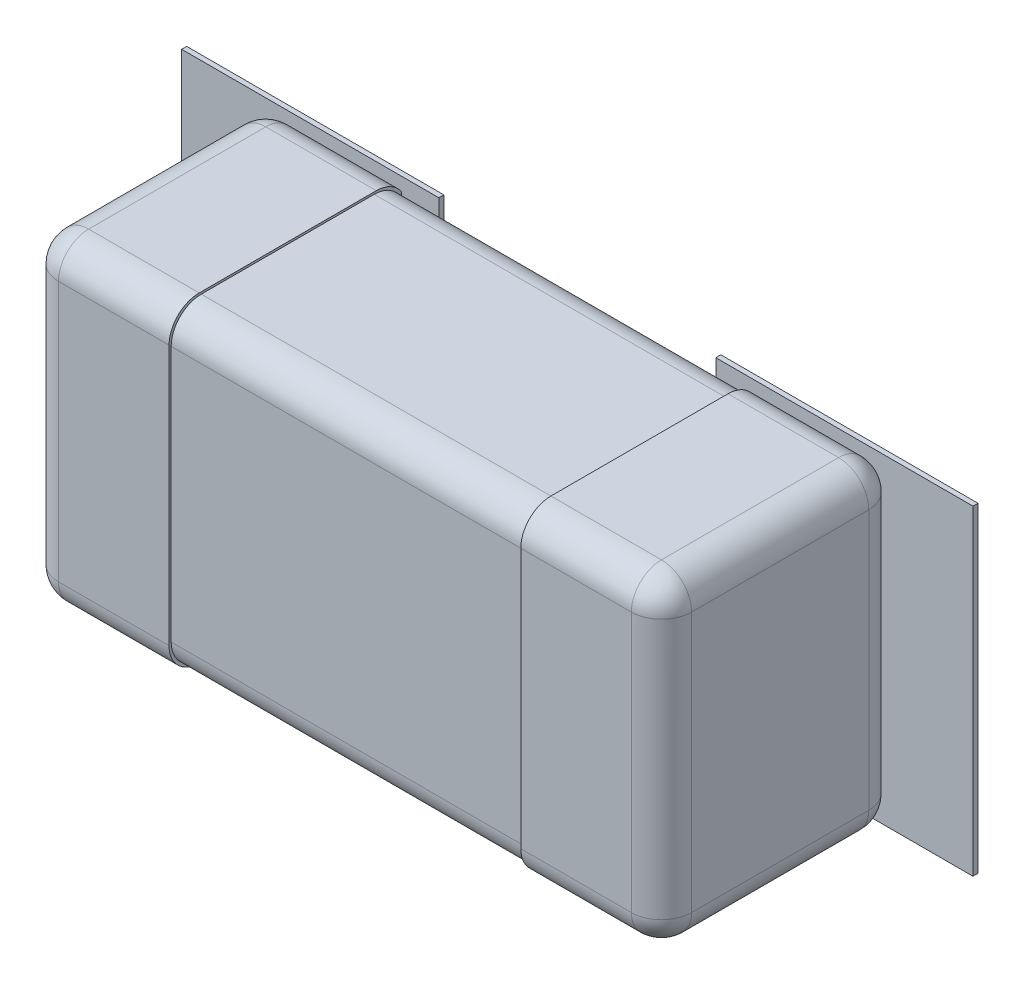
ISO-10303-21;
HEADER;
FILE_DESCRIPTION(('STEP AP214'),'2;1');
FILE_NAME('part.step','',(''),(''),'','','');
FILE_SCHEMA(('AUTOMOTIVE_DESIGN { 1 0 10303 214 1 1 1 1 }'));
ENDSEC;
DATA;
#1=APPLICATION_CONTEXT('core data for automotive mechanical design processes');
#2=APPLICATION_PROTOCOL_DEFINITION('international standard','automotive_design',2000,#1);
#3=PRODUCT_CONTEXT('',#1,'mechanical');
#4=PRODUCT('Part','Part','',(#3));
#5=PRODUCT_RELATED_PRODUCT_CATEGORY('part','',(#4));
#6=PRODUCT_DEFINITION_FORMATION('','',#4);
#7=PRODUCT_DEFINITION_CONTEXT('part definition',#1,'design');
#8=PRODUCT_DEFINITION('design','',#6,#7);
#9=PRODUCT_DEFINITION_SHAPE('','',#8);
#10=(LENGTH_UNIT() NAMED_UNIT(*) SI_UNIT(.MILLI.,.METRE.));
#11=(NAMED_UNIT(*) PLANE_ANGLE_UNIT() SI_UNIT($,.RADIAN.));
#12=(NAMED_UNIT(*) SI_UNIT($,.STERADIAN.) SOLID_ANGLE_UNIT());
#13=UNCERTAINTY_MEASURE_WITH_UNIT(LENGTH_MEASURE(1.E-05),#10,'distance_accuracy_value','');
#14=(GEOMETRIC_REPRESENTATION_CONTEXT(3) GLOBAL_UNCERTAINTY_ASSIGNED_CONTEXT((#13)) GLOBAL_UNIT_ASSIGNED_CONTEXT((#10,
#11,#12)) REPRESENTATION_CONTEXT('',''));
#15=CARTESIAN_POINT('',(0.,0.,0.));
#16=DIRECTION('',(0.,0.,1.));
#17=DIRECTION('',(1.,0.,0.));
#18=AXIS2_PLACEMENT_3D('',#15,#16,#17);
#19=CARTESIAN_POINT('',(-0.800000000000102,0.404999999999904,0.0762));
#20=DIRECTION('',(-1.,0.,0.));
#21=DIRECTION('',(0.,0.,1.));
#22=AXIS2_PLACEMENT_3D('',#19,#20,#21);
#23=PLANE('',#22);
#24=DIRECTION('',(0.,0.,-1.));
#25=VECTOR('',#24,1.);
#26=CARTESIAN_POINT('',(-0.800000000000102,0.328799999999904,1.4582402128));
#27=LINE('',#26,#25);
#28=CARTESIAN_POINT('',(-0.800000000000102,0.328799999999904,0.1524));
#29=VERTEX_POINT('',#28);
#30=CARTESIAN_POINT('',(-0.800000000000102,0.328799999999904,0.599948));
#31=VERTEX_POINT('',#30);
#32=EDGE_CURVE('E163',#29,#31,#27,.F.);
#33=ORIENTED_EDGE('',*,*,#32,.F.);
#34=DIRECTION('',(0.,1.,0.));
#35=VECTOR('',#34,1.);
#36=CARTESIAN_POINT('',(-0.800000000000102,-1.4609268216,0.1524));
#37=LINE('',#36,#35);
#38=CARTESIAN_POINT('',(-0.800000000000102,-0.328799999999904,0.1524));
#39=VERTEX_POINT('',#38);
#40=EDGE_CURVE('E168',#39,#29,#37,.T.);
#41=ORIENTED_EDGE('',*,*,#40,.F.);
#42=DIRECTION('',(0.,0.,-1.));
#43=VECTOR('',#42,1.);
#44=CARTESIAN_POINT('',(-0.800000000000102,-0.328799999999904,1.4582402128));
#45=LINE('',#44,#43);
#46=CARTESIAN_POINT('',(-0.800000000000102,-0.328799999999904,0.599948));
#47=VERTEX_POINT('',#46);
#48=EDGE_CURVE('E68',#47,#39,#45,.T.);
#49=ORIENTED_EDGE('',*,*,#48,.F.);
#50=DIRECTION('',(0.,-1.,0.));
#51=VECTOR('',#50,1.);
#52=CARTESIAN_POINT('',(-0.800000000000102,1.4609268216,0.599948));
#53=LINE('',#52,#51);
#54=EDGE_CURVE('E87',#31,#47,#53,.T.);
#55=ORIENTED_EDGE('',*,*,#54,.F.);
#56=EDGE_LOOP('',(#33,#41,#49,#55));
#57=FACE_BOUND('',#56,.T.);
#58=ADVANCED_FACE('F16',(#57),#23,.T.);
#59=CARTESIAN_POINT('',(0.,0.,0.0762));
#60=DIRECTION('',(0.,0.,1.));
#61=DIRECTION('',(1.,0.,0.));
#62=AXIS2_PLACEMENT_3D('',#59,#60,#61);
#63=PLANE('',#62);
#64=DIRECTION('',(1.,0.,0.));
#65=VECTOR('',#64,1.);
#66=CARTESIAN_POINT('',(-0.999871,-0.405003,0.0762));
#67=LINE('',#66,#65);
#68=CARTESIAN_POINT('',(-0.999871,-0.405003,0.0762));
#69=VERTEX_POINT('',#68);
#70=CARTESIAN_POINT('',(-0.349885,-0.405003,0.0762));
#71=VERTEX_POINT('',#70);
#72=EDGE_CURVE('E152',#69,#71,#67,.T.);
#73=ORIENTED_EDGE('',*,*,#72,.F.);
#74=DIRECTION('',(0.,1.,0.));
#75=VECTOR('',#74,1.);
#76=CARTESIAN_POINT('',(-0.999871,0.405003,0.0762));
#77=LINE('',#76,#75);
#78=CARTESIAN_POINT('',(-0.999871,0.405003,0.0762));
#79=VERTEX_POINT('',#78);
#80=EDGE_CURVE('E158',#79,#69,#77,.F.);
#81=ORIENTED_EDGE('',*,*,#80,.F.);
#82=DIRECTION('',(1.,0.,0.));
#83=VECTOR('',#82,1.);
#84=CARTESIAN_POINT('',(-0.349885,0.405003,0.0762));
#85=LINE('',#84,#83);
#86=CARTESIAN_POINT('',(-0.349885,0.405003,0.0762));
#87=VERTEX_POINT('',#86);
#88=EDGE_CURVE('E138',#87,#79,#85,.F.);
#89=ORIENTED_EDGE('',*,*,#88,.F.);
#90=DIRECTION('',(0.,1.,0.));
#91=VECTOR('',#90,1.);
#92=CARTESIAN_POINT('',(-0.349885,-0.405003,0.0762));
#93=LINE('',#92,#91);
#94=EDGE_CURVE('E145',#71,#87,#93,.T.);
#95=ORIENTED_EDGE('',*,*,#94,.F.);
#96=EDGE_LOOP('',(#73,#81,#89,#95));
#97=FACE_BOUND('',#96,.T.);
#98=ADVANCED_FACE('F371',(#97),#63,.F.);
#99=CARTESIAN_POINT('',(0.,0.,0.0762));
#100=DIRECTION('',(0.,0.,1.));
#101=DIRECTION('',(1.,0.,0.));
#102=AXIS2_PLACEMENT_3D('',#99,#100,#101);
#103=PLANE('',#102);
#104=DIRECTION('',(1.,0.,0.));
#105=VECTOR('',#104,1.);
#106=CARTESIAN_POINT('',(0.349885,-0.405003,0.0762));
#107=LINE('',#106,#105);
#108=CARTESIAN_POINT('',(0.349885,-0.405003,0.0762));
#109=VERTEX_POINT('',#108);
#110=CARTESIAN_POINT('',(0.999871,-0.405003,0.0762));
#111=VERTEX_POINT('',#110);
#112=EDGE_CURVE('E113',#109,#111,#107,.T.);
#113=ORIENTED_EDGE('',*,*,#112,.F.);
#114=DIRECTION('',(0.,1.,0.));
#115=VECTOR('',#114,1.);
#116=CARTESIAN_POINT('',(0.349885,0.405003,0.0762));
#117=LINE('',#116,#115);
#118=CARTESIAN_POINT('',(0.349885,0.405003,0.0762));
#119=VERTEX_POINT('',#118);
#120=EDGE_CURVE('E120',#119,#109,#117,.F.);
#121=ORIENTED_EDGE('',*,*,#120,.F.);
#122=DIRECTION('',(1.,0.,0.));
#123=VECTOR('',#122,1.);
#124=CARTESIAN_POINT('',(0.999871,0.405003,0.0762));
#125=LINE('',#124,#123);
#126=CARTESIAN_POINT('',(0.999871,0.405003,0.0762));
#127=VERTEX_POINT('',#126);
#128=EDGE_CURVE('E127',#127,#119,#125,.F.);
#129=ORIENTED_EDGE('',*,*,#128,.F.);
#130=DIRECTION('',(0.,1.,0.));
#131=VECTOR('',#130,1.);
#132=CARTESIAN_POINT('',(0.999871,-0.405003,0.0762));
#133=LINE('',#132,#131);
#134=EDGE_CURVE('E133',#111,#127,#133,.T.);
#135=ORIENTED_EDGE('',*,*,#134,.F.);
#136=EDGE_LOOP('',(#113,#121,#129,#135));
#137=FACE_BOUND('',#136,.T.);
#138=ADVANCED_FACE('F368',(#137),#103,.F.);
#139=CARTESIAN_POINT('',(0.800000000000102,-0.404999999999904,0.0762));
#140=DIRECTION('',(1.,0.,0.));
#141=DIRECTION('',(0.,0.,-1.));
#142=AXIS2_PLACEMENT_3D('',#139,#140,#141);
#143=PLANE('',#142);
#144=DIRECTION('',(0.,0.,-1.));
#145=VECTOR('',#144,1.);
#146=CARTESIAN_POINT('',(0.800000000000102,0.328799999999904,1.4582402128));
#147=LINE('',#146,#145);
#148=CARTESIAN_POINT('',(0.800000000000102,0.328799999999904,0.599948));
#149=VERTEX_POINT('',#148);
#150=CARTESIAN_POINT('',(0.800000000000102,0.328799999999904,0.1524));
#151=VERTEX_POINT('',#150);
#152=EDGE_CURVE('E109',#149,#151,#147,.T.);
#153=ORIENTED_EDGE('',*,*,#152,.F.);
#154=DIRECTION('',(0.,1.,0.));
#155=VECTOR('',#154,1.);
#156=CARTESIAN_POINT('',(0.800000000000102,-1.4609268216,0.599948));
#157=LINE('',#156,#155);
#158=CARTESIAN_POINT('',(0.800000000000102,-0.328799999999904,0.599948));
#159=VERTEX_POINT('',#158);
#160=EDGE_CURVE('E104',#159,#149,#157,.T.);
#161=ORIENTED_EDGE('',*,*,#160,.F.);
#162=DIRECTION('',(0.,0.,-1.));
#163=VECTOR('',#162,1.);
#164=CARTESIAN_POINT('',(0.800000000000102,-0.328799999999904,1.4582402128));
#165=LINE('',#164,#163);
#166=CARTESIAN_POINT('',(0.800000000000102,-0.328799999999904,0.1524));
#167=VERTEX_POINT('',#166);
#168=EDGE_CURVE('E94',#167,#159,#165,.F.);
#169=ORIENTED_EDGE('',*,*,#168,.F.);
#170=DIRECTION('',(0.,-1.,0.));
#171=VECTOR('',#170,1.);
#172=CARTESIAN_POINT('',(0.800000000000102,1.4609268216,0.1524));
#173=LINE('',#172,#171);
#174=EDGE_CURVE('E99',#151,#167,#173,.T.);
#175=ORIENTED_EDGE('',*,*,#174,.F.);
#176=EDGE_LOOP('',(#153,#161,#169,#175));
#177=FACE_BOUND('',#176,.T.);
#178=ADVANCED_FACE('F365',(#177),#143,.T.);
#179=CARTESIAN_POINT('',(-0.723800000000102,-0.328799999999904,1.4582402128));
#180=DIRECTION('',(0.,0.,-1.));
#181=DIRECTION('',(-1.,0.,0.));
#182=AXIS2_PLACEMENT_3D('',#179,#180,#181);
#183=CYLINDRICAL_SURFACE('',#182,0.0762);
#184=CARTESIAN_POINT('',(-0.723800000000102,-0.328799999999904,0.1524));
#185=DIRECTION('',(0.,0.,-1.));
#186=DIRECTION('',(-1.,0.,0.));
#187=AXIS2_PLACEMENT_3D('',#184,#185,#186);
#188=CIRCLE('',#187,0.0762);
#189=CARTESIAN_POINT('',(-0.723800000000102,-0.404999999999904,0.1524));
#190=VERTEX_POINT('',#189);
#191=EDGE_CURVE('E166',#190,#39,#188,.T.);
#192=ORIENTED_EDGE('',*,*,#191,.F.);
#193=DIRECTION('',(0.,0.,-1.));
#194=VECTOR('',#193,1.);
#195=CARTESIAN_POINT('',(-0.723800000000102,-0.404999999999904,0.0762));
#196=LINE('',#195,#194);
#197=CARTESIAN_POINT('',(-0.723800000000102,-0.404999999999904,0.599947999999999));
#198=VERTEX_POINT('',#197);
#199=EDGE_CURVE('E85',#198,#190,#196,.T.);
#200=ORIENTED_EDGE('',*,*,#199,.F.);
#201=CARTESIAN_POINT('',(-0.723800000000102,-0.328799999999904,0.599948));
#202=DIRECTION('',(0.,0.,1.));
#203=DIRECTION('',(-0.707106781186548,-0.707106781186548,0.));
#204=AXIS2_PLACEMENT_3D('',#201,#202,#203);
#205=CIRCLE('',#204,0.0762);
#206=CARTESIAN_POINT('',(-0.777681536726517,-0.382681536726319,0.599948));
#207=VERTEX_POINT('',#206);
#208=EDGE_CURVE('E78',#207,#198,#205,.T.);
#209=ORIENTED_EDGE('',*,*,#208,.F.);
#210=CARTESIAN_POINT('',(-0.723800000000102,-0.328799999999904,0.599948));
#211=DIRECTION('',(0.,0.,-1.));
#212=DIRECTION('',(-1.,0.,0.));
#213=AXIS2_PLACEMENT_3D('',#210,#211,#212);
#214=CIRCLE('',#213,0.0762);
#215=EDGE_CURVE('E19',#47,#207,#214,.F.);
#216=ORIENTED_EDGE('',*,*,#215,.F.);
#217=ORIENTED_EDGE('',*,*,#48,.T.);
#218=EDGE_LOOP('',(#192,#200,#209,#216,#217));
#219=FACE_BOUND('',#218,.T.);
#220=ADVANCED_FACE('F83',(#219),#183,.T.);
#221=CARTESIAN_POINT('',(-0.723800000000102,-0.328799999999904,0.599948));
#222=DIRECTION('',(-0.707106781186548,-0.707106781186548,0.));
#223=DIRECTION('',(0.,0.,1.));
#224=AXIS2_PLACEMENT_3D('',#221,#222,#223);
#225=SPHERICAL_SURFACE('',#224,0.0762);
#226=ORIENTED_EDGE('',*,*,#215,.T.);
#227=ORIENTED_EDGE('',*,*,#208,.T.);
#228=CARTESIAN_POINT('',(-0.723800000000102,-0.328799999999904,0.599948));
#229=DIRECTION('',(1.,0.,0.));
#230=DIRECTION('',(0.,0.,-1.));
#231=AXIS2_PLACEMENT_3D('',#228,#229,#230);
#232=CIRCLE('',#231,0.0762);
#233=CARTESIAN_POINT('',(-0.723800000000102,-0.328799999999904,0.676148));
#234=VERTEX_POINT('',#233);
#235=EDGE_CURVE('E549',#234,#198,#232,.T.);
#236=ORIENTED_EDGE('',*,*,#235,.F.);
#237=CARTESIAN_POINT('',(-0.723800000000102,-0.328799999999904,0.599948));
#238=DIRECTION('',(0.,-1.,0.));
#239=DIRECTION('',(0.,0.,-1.));
#240=AXIS2_PLACEMENT_3D('',#237,#238,#239);
#241=CIRCLE('',#240,0.0762);
#242=EDGE_CURVE('E80',#47,#234,#241,.F.);
#243=ORIENTED_EDGE('',*,*,#242,.F.);
#244=EDGE_LOOP('',(#226,#227,#236,#243));
#245=FACE_BOUND('',#244,.T.);
#246=ADVANCED_FACE('F76',(#245),#225,.T.);
#247=CARTESIAN_POINT('',(-0.723800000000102,1.4609268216,0.599948));
#248=DIRECTION('',(0.,-1.,0.));
#249=DIRECTION('',(0.,0.,-1.));
#250=AXIS2_PLACEMENT_3D('',#247,#248,#249);
#251=CYLINDRICAL_SURFACE('',#250,0.0762);
#252=ORIENTED_EDGE('',*,*,#242,.T.);
#253=DIRECTION('',(0.,1.,0.));
#254=VECTOR('',#253,1.);
#255=CARTESIAN_POINT('',(-0.723800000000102,0.,0.676148));
#256=LINE('',#255,#254);
#257=CARTESIAN_POINT('',(-0.723800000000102,0.328799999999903,0.676148));
#258=VERTEX_POINT('',#257);
#259=EDGE_CURVE('E345',#258,#234,#256,.F.);
#260=ORIENTED_EDGE('',*,*,#259,.F.);
#261=CARTESIAN_POINT('',(-0.723800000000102,0.328799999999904,0.599948));
#262=DIRECTION('',(0.,1.,0.));
#263=DIRECTION('',(-0.707106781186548,0.,0.707106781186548));
#264=AXIS2_PLACEMENT_3D('',#261,#262,#263);
#265=CIRCLE('',#264,0.0762);
#266=CARTESIAN_POINT('',(-0.777681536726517,0.328799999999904,0.653829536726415));
#267=VERTEX_POINT('',#266);
#268=EDGE_CURVE('E352',#267,#258,#265,.T.);
#269=ORIENTED_EDGE('',*,*,#268,.F.);
#270=CARTESIAN_POINT('',(-0.723800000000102,0.328799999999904,0.599948));
#271=DIRECTION('',(0.,-1.,0.));
#272=DIRECTION('',(0.,0.,-1.));
#273=AXIS2_PLACEMENT_3D('',#270,#271,#272);
#274=CIRCLE('',#273,0.0762);
#275=EDGE_CURVE('E662',#31,#267,#274,.F.);
#276=ORIENTED_EDGE('',*,*,#275,.F.);
#277=ORIENTED_EDGE('',*,*,#54,.T.);
#278=EDGE_LOOP('',(#252,#260,#269,#276,#277));
#279=FACE_BOUND('',#278,.T.);
#280=ADVANCED_FACE('F356',(#279),#251,.T.);
#281=CARTESIAN_POINT('',(-0.723800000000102,0.328799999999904,0.599948));
#282=DIRECTION('',(-0.707106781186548,0.,0.707106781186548));
#283=DIRECTION('',(0.,1.,0.));
#284=AXIS2_PLACEMENT_3D('',#281,#282,#283);
#285=SPHERICAL_SURFACE('',#284,0.0762);
#286=ORIENTED_EDGE('',*,*,#275,.T.);
#287=ORIENTED_EDGE('',*,*,#268,.T.);
#288=CARTESIAN_POINT('',(-0.723800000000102,0.328799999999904,0.599948));
#289=DIRECTION('',(-1.,0.,0.));
#290=DIRECTION('',(0.,0.,1.));
#291=AXIS2_PLACEMENT_3D('',#288,#289,#290);
#292=CIRCLE('',#291,0.0762);
#293=CARTESIAN_POINT('',(-0.723800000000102,0.404999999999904,0.599948));
#294=VERTEX_POINT('',#293);
#295=EDGE_CURVE('E544',#294,#258,#292,.F.);
#296=ORIENTED_EDGE('',*,*,#295,.F.);
#297=CARTESIAN_POINT('',(-0.723800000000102,0.328799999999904,0.599948));
#298=DIRECTION('',(0.,0.,-1.));
#299=DIRECTION('',(-1.,0.,0.));
#300=AXIS2_PLACEMENT_3D('',#297,#298,#299);
#301=CIRCLE('',#300,0.0762);
#302=EDGE_CURVE('E167',#31,#294,#301,.T.);
#303=ORIENTED_EDGE('',*,*,#302,.F.);
#304=EDGE_LOOP('',(#286,#287,#296,#303));
#305=FACE_BOUND('',#304,.T.);
#306=ADVANCED_FACE('F353',(#305),#285,.T.);
#307=CARTESIAN_POINT('',(-0.723800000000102,0.328799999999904,1.4582402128));
#308=DIRECTION('',(0.,0.,-1.));
#309=DIRECTION('',(-1.,0.,0.));
#310=AXIS2_PLACEMENT_3D('',#307,#308,#309);
#311=CYLINDRICAL_SURFACE('',#310,0.0762);
#312=CARTESIAN_POINT('',(-0.723800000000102,0.328799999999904,0.1524));
#313=DIRECTION('',(0.,0.,-1.));
#314=DIRECTION('',(-1.,0.,0.));
#315=AXIS2_PLACEMENT_3D('',#312,#313,#314);
#316=CIRCLE('',#315,0.0762);
#317=CARTESIAN_POINT('',(-0.777681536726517,0.382681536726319,0.1524));
#318=VERTEX_POINT('',#317);
#319=EDGE_CURVE('E645',#29,#318,#316,.T.);
#320=ORIENTED_EDGE('',*,*,#319,.F.);
#321=ORIENTED_EDGE('',*,*,#32,.T.);
#322=ORIENTED_EDGE('',*,*,#302,.T.);
#323=DIRECTION('',(0.,0.,1.));
#324=VECTOR('',#323,1.);
#325=CARTESIAN_POINT('',(-0.723800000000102,0.404999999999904,0.0762));
#326=LINE('',#325,#324);
#327=CARTESIAN_POINT('',(-0.723800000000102,0.404999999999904,0.1524));
#328=VERTEX_POINT('',#327);
#329=EDGE_CURVE('E340',#328,#294,#326,.T.);
#330=ORIENTED_EDGE('',*,*,#329,.F.);
#331=CARTESIAN_POINT('',(-0.723800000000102,0.328799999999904,0.1524));
#332=DIRECTION('',(0.,0.,-1.));
#333=DIRECTION('',(-0.707106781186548,0.707106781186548,0.));
#334=AXIS2_PLACEMENT_3D('',#331,#332,#333);
#335=CIRCLE('',#334,0.0762);
#336=EDGE_CURVE('E142',#318,#328,#335,.T.);
#337=ORIENTED_EDGE('',*,*,#336,.F.);
#338=EDGE_LOOP('',(#320,#321,#322,#330,#337));
#339=FACE_BOUND('',#338,.T.);
#340=ADVANCED_FACE('F333',(#339),#311,.T.);
#341=CARTESIAN_POINT('',(-0.723800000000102,-0.328799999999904,0.1524));
#342=DIRECTION('',(-0.707106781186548,0.,-0.707106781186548));
#343=DIRECTION('',(0.,-1.,0.));
#344=AXIS2_PLACEMENT_3D('',#341,#342,#343);
#345=SPHERICAL_SURFACE('',#344,0.0762);
#346=CARTESIAN_POINT('',(-0.723800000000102,-0.328799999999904,0.1524));
#347=DIRECTION('',(0.,1.,0.));
#348=DIRECTION('',(0.,0.,1.));
#349=AXIS2_PLACEMENT_3D('',#346,#347,#348);
#350=CIRCLE('',#349,0.0762);
#351=CARTESIAN_POINT('',(-0.765921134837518,-0.328799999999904,0.0889));
#352=VERTEX_POINT('',#351);
#353=CARTESIAN_POINT('',(-0.777681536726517,-0.328799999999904,0.0985184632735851));
#354=VERTEX_POINT('',#353);
#355=EDGE_CURVE('E34',#352,#354,#350,.T.);
#356=ORIENTED_EDGE('',*,*,#355,.F.);
#357=CARTESIAN_POINT('',(-0.723800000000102,-0.370921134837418,0.0888999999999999));
#358=CARTESIAN_POINT('',(-0.728547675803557,-0.370952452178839,0.0889000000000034));
#359=CARTESIAN_POINT('',(-0.733275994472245,-0.37012301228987,0.0889000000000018));
#360=CARTESIAN_POINT('',(-0.742208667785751,-0.366970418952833,0.0888999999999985));
#361=CARTESIAN_POINT('',(-0.746413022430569,-0.364647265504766,0.0888999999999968));
#362=CARTESIAN_POINT('',(-0.753812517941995,-0.358735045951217,0.0889000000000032));
#363=CARTESIAN_POINT('',(-0.757007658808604,-0.355145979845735,0.0889000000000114));
#364=CARTESIAN_POINT('',(-0.762025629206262,-0.347108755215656,0.0889000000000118));
#365=CARTESIAN_POINT('',(-0.76384845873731,-0.342660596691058,0.088900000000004));
#366=CARTESIAN_POINT('',(-0.765581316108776,-0.335011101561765,0.0888999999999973));
#367=CARTESIAN_POINT('',(-0.76593245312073,-0.33190399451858,0.0888999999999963));
#368=CARTESIAN_POINT('',(-0.765921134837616,-0.328799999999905,0.0889000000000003));
#369=B_SPLINE_CURVE_WITH_KNOTS('',3,(#357,#358,#359,#360,#361,#362,#363,#364,#365,#366,#367,
#368),.UNSPECIFIED.,.F.,.F.,(4,2,2,2,2,4),(0.,0.0141430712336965,0.0282861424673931,
0.0424292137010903,0.0565722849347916,0.0658755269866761),.UNSPECIFIED.);
#370=CARTESIAN_POINT('',(-0.723800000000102,-0.370921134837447,0.0889));
#371=VERTEX_POINT('',#370);
#372=EDGE_CURVE('E315',#371,#352,#369,.T.);
#373=ORIENTED_EDGE('',*,*,#372,.F.);
#374=CARTESIAN_POINT('',(-0.723800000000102,-0.328799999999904,0.1524));
#375=DIRECTION('',(-1.,0.,0.));
#376=DIRECTION('',(0.,0.,1.));
#377=AXIS2_PLACEMENT_3D('',#374,#375,#376);
#378=CIRCLE('',#377,0.0762);
#379=EDGE_CURVE('E559',#190,#371,#378,.F.);
#380=ORIENTED_EDGE('',*,*,#379,.F.);
#381=ORIENTED_EDGE('',*,*,#191,.T.);
#382=CARTESIAN_POINT('',(-0.723800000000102,-0.328799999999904,0.1524));
#383=DIRECTION('',(0.,1.,0.));
#384=DIRECTION('',(0.,0.,1.));
#385=AXIS2_PLACEMENT_3D('',#382,#383,#384);
#386=CIRCLE('',#385,0.0762);
#387=EDGE_CURVE('E172',#354,#39,#386,.T.);
#388=ORIENTED_EDGE('',*,*,#387,.F.);
#389=EDGE_LOOP('',(#356,#373,#380,#381,#388));
#390=FACE_BOUND('',#389,.T.);
#391=ADVANCED_FACE('F326',(#390),#345,.T.);
#392=CARTESIAN_POINT('',(-0.723800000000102,-1.4609268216,0.1524));
#393=DIRECTION('',(0.,1.,0.));
#394=DIRECTION('',(0.,0.,1.));
#395=AXIS2_PLACEMENT_3D('',#392,#393,#394);
#396=CYLINDRICAL_SURFACE('',#395,0.0762);
#397=CARTESIAN_POINT('',(-0.723800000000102,0.328799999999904,0.1524));
#398=DIRECTION('',(0.,1.,0.));
#399=DIRECTION('',(0.,0.,1.));
#400=AXIS2_PLACEMENT_3D('',#397,#398,#399);
#401=CIRCLE('',#400,0.0762);
#402=CARTESIAN_POINT('',(-0.765921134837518,0.328799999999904,0.0889));
#403=VERTEX_POINT('',#402);
#404=EDGE_CURVE('E171',#403,#29,#401,.T.);
#405=ORIENTED_EDGE('',*,*,#404,.F.);
#406=DIRECTION('',(0.,1.,0.));
#407=VECTOR('',#406,1.);
#408=CARTESIAN_POINT('',(-0.76592113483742,0.,0.0889));
#409=LINE('',#408,#407);
#410=EDGE_CURVE('E322',#352,#403,#409,.T.);
#411=ORIENTED_EDGE('',*,*,#410,.F.);
#412=ORIENTED_EDGE('',*,*,#355,.T.);
#413=ORIENTED_EDGE('',*,*,#387,.T.);
#414=ORIENTED_EDGE('',*,*,#40,.T.);
#415=EDGE_LOOP('',(#405,#411,#412,#413,#414));
#416=FACE_BOUND('',#415,.T.);
#417=ADVANCED_FACE('F332',(#416),#396,.T.);
#418=CARTESIAN_POINT('',(-0.723800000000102,0.328799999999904,0.1524));
#419=DIRECTION('',(-0.707106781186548,0.707106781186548,0.));
#420=DIRECTION('',(0.,0.,-1.));
#421=AXIS2_PLACEMENT_3D('',#418,#419,#420);
#422=SPHERICAL_SURFACE('',#421,0.0762);
#423=CARTESIAN_POINT('',(-0.723800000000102,0.328799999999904,0.1524));
#424=DIRECTION('',(1.,0.,0.));
#425=DIRECTION('',(0.,0.,-1.));
#426=AXIS2_PLACEMENT_3D('',#423,#424,#425);
#427=CIRCLE('',#426,0.0762);
#428=CARTESIAN_POINT('',(-0.723800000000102,0.370921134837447,0.0889));
#429=VERTEX_POINT('',#428);
#430=EDGE_CURVE('E324',#429,#328,#427,.T.);
#431=ORIENTED_EDGE('',*,*,#430,.F.);
#432=CARTESIAN_POINT('',(-0.765921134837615,0.328799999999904,0.0889));
#433=CARTESIAN_POINT('',(-0.765952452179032,0.333547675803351,0.0888999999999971));
#434=CARTESIAN_POINT('',(-0.765123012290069,0.338275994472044,0.0889000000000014));
#435=CARTESIAN_POINT('',(-0.76197041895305,0.347208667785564,0.0889000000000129));
#436=CARTESIAN_POINT('',(-0.759647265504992,0.35141302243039,0.0889000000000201));
#437=CARTESIAN_POINT('',(-0.753735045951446,0.358812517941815,0.088900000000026));
#438=CARTESIAN_POINT('',(-0.750145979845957,0.362007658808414,0.0889000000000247));
#439=CARTESIAN_POINT('',(-0.742108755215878,0.367025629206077,0.0889000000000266));
#440=CARTESIAN_POINT('',(-0.737660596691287,0.368848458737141,0.0889000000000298));
#441=CARTESIAN_POINT('',(-0.730011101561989,0.37058131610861,0.088900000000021));
#442=CARTESIAN_POINT('',(-0.726903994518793,0.370932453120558,0.0889000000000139));
#443=CARTESIAN_POINT('',(-0.723800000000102,0.370921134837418,0.0889));
#444=B_SPLINE_CURVE_WITH_KNOTS('',3,(#432,#433,#434,#435,#436,#437,#438,#439,#440,#441,#442,
#443),.UNSPECIFIED.,.F.,.F.,(4,2,2,2,2,4),(0.,0.0141430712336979,0.0282861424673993,
0.0424292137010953,0.0565722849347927,0.0658755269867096),.UNSPECIFIED.);
#445=EDGE_CURVE('E308',#403,#429,#444,.T.);
#446=ORIENTED_EDGE('',*,*,#445,.F.);
#447=ORIENTED_EDGE('',*,*,#404,.T.);
#448=ORIENTED_EDGE('',*,*,#319,.T.);
#449=ORIENTED_EDGE('',*,*,#336,.T.);
#450=EDGE_LOOP('',(#431,#446,#447,#448,#449));
#451=FACE_BOUND('',#450,.T.);
#452=ADVANCED_FACE('F634',(#451),#422,.T.);
#453=CARTESIAN_POINT('',(-0.349885,0.405003,0.0762));
#454=DIRECTION('',(0.,1.,0.));
#455=DIRECTION('',(0.,0.,1.));
#456=AXIS2_PLACEMENT_3D('',#453,#454,#455);
#457=PLANE('',#456);
#458=DIRECTION('',(0.,0.,-1.));
#459=VECTOR('',#458,1.);
#460=CARTESIAN_POINT('',(-0.349885,0.405003,0.0762));
#461=LINE('',#460,#459);
#462=CARTESIAN_POINT('',(-0.349885,0.405003,0.0889));
#463=VERTEX_POINT('',#462);
#464=EDGE_CURVE('E148',#87,#463,#461,.F.);
#465=ORIENTED_EDGE('',*,*,#464,.F.);
#466=ORIENTED_EDGE('',*,*,#88,.T.);
#467=DIRECTION('',(0.,0.,1.));
#468=VECTOR('',#467,1.);
#469=CARTESIAN_POINT('',(-0.999871,0.405003,0.0762));
#470=LINE('',#469,#468);
#471=CARTESIAN_POINT('',(-0.999871,0.405003,0.0889));
#472=VERTEX_POINT('',#471);
#473=EDGE_CURVE('E141',#472,#79,#470,.F.);
#474=ORIENTED_EDGE('',*,*,#473,.F.);
#475=DIRECTION('',(1.,0.,0.));
#476=VECTOR('',#475,1.);
#477=CARTESIAN_POINT('',(0.,0.405003,0.0889));
#478=LINE('',#477,#476);
#479=EDGE_CURVE('E878',#463,#472,#478,.F.);
#480=ORIENTED_EDGE('',*,*,#479,.F.);
#481=EDGE_LOOP('',(#465,#466,#474,#480));
#482=FACE_BOUND('',#481,.T.);
#483=ADVANCED_FACE('F631',(#482),#457,.T.);
#484=CARTESIAN_POINT('',(-0.999871,0.405003,0.0762));
#485=DIRECTION('',(-1.,0.,0.));
#486=DIRECTION('',(0.,0.,1.));
#487=AXIS2_PLACEMENT_3D('',#484,#485,#486);
#488=PLANE('',#487);
#489=ORIENTED_EDGE('',*,*,#473,.T.);
#490=ORIENTED_EDGE('',*,*,#80,.T.);
#491=DIRECTION('',(0.,0.,-1.));
#492=VECTOR('',#491,1.);
#493=CARTESIAN_POINT('',(-0.999871,-0.405003,0.0762));
#494=LINE('',#493,#492);
#495=CARTESIAN_POINT('',(-0.999871,-0.405003,0.0889));
#496=VERTEX_POINT('',#495);
#497=EDGE_CURVE('E155',#496,#69,#494,.T.);
#498=ORIENTED_EDGE('',*,*,#497,.F.);
#499=DIRECTION('',(0.,1.,0.));
#500=VECTOR('',#499,1.);
#501=CARTESIAN_POINT('',(-0.999871,0.,0.0889));
#502=LINE('',#501,#500);
#503=EDGE_CURVE('E886',#472,#496,#502,.F.);
#504=ORIENTED_EDGE('',*,*,#503,.F.);
#505=EDGE_LOOP('',(#489,#490,#498,#504));
#506=FACE_BOUND('',#505,.T.);
#507=ADVANCED_FACE('F627',(#506),#488,.T.);
#508=CARTESIAN_POINT('',(-0.999871,-0.405003,0.0762));
#509=DIRECTION('',(0.,-1.,0.));
#510=DIRECTION('',(0.,0.,-1.));
#511=AXIS2_PLACEMENT_3D('',#508,#509,#510);
#512=PLANE('',#511);
#513=ORIENTED_EDGE('',*,*,#497,.T.);
#514=ORIENTED_EDGE('',*,*,#72,.T.);
#515=DIRECTION('',(0.,0.,-1.));
#516=VECTOR('',#515,1.);
#517=CARTESIAN_POINT('',(-0.349885,-0.405003,0.0762));
#518=LINE('',#517,#516);
#519=CARTESIAN_POINT('',(-0.349885,-0.405003,0.0889));
#520=VERTEX_POINT('',#519);
#521=EDGE_CURVE('E149',#520,#71,#518,.T.);
#522=ORIENTED_EDGE('',*,*,#521,.F.);
#523=DIRECTION('',(1.,0.,0.));
#524=VECTOR('',#523,1.);
#525=CARTESIAN_POINT('',(0.,-0.405003,0.0889));
#526=LINE('',#525,#524);
#527=EDGE_CURVE('E888',#496,#520,#526,.T.);
#528=ORIENTED_EDGE('',*,*,#527,.F.);
#529=EDGE_LOOP('',(#513,#514,#522,#528));
#530=FACE_BOUND('',#529,.T.);
#531=ADVANCED_FACE('F623',(#530),#512,.T.);
#532=CARTESIAN_POINT('',(-0.444400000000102,-0.404999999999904,0.081534));
#533=DIRECTION('',(0.,0.,1.));
#534=DIRECTION('',(1.,0.,0.));
#535=AXIS2_PLACEMENT_3D('',#532,#533,#534);
#536=PLANE('',#535);
#537=DIRECTION('',(0.,1.,0.));
#538=VECTOR('',#537,1.);
#539=CARTESIAN_POINT('',(0.349885,0.405003,0.081534));
#540=LINE('',#539,#538);
#541=CARTESIAN_POINT('',(0.349885,-0.323465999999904,0.081534));
#542=VERTEX_POINT('',#541);
#543=CARTESIAN_POINT('',(0.349885,0.323465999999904,0.081534));
#544=VERTEX_POINT('',#543);
#545=EDGE_CURVE('E103',#542,#544,#540,.T.);
#546=ORIENTED_EDGE('',*,*,#545,.F.);
#547=DIRECTION('',(1.,0.,0.));
#548=VECTOR('',#547,1.);
#549=CARTESIAN_POINT('',(-3.6067346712,-0.323465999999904,0.081534));
#550=LINE('',#549,#548);
#551=CARTESIAN_POINT('',(-0.349885,-0.323465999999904,0.081534));
#552=VERTEX_POINT('',#551);
#553=EDGE_CURVE('E906',#552,#542,#550,.T.);
#554=ORIENTED_EDGE('',*,*,#553,.F.);
#555=DIRECTION('',(0.,1.,0.));
#556=VECTOR('',#555,1.);
#557=CARTESIAN_POINT('',(-0.349885,-0.405003,0.081534));
#558=LINE('',#557,#556);
#559=CARTESIAN_POINT('',(-0.349885,0.323465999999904,0.081534));
#560=VERTEX_POINT('',#559);
#561=EDGE_CURVE('E117',#560,#552,#558,.F.);
#562=ORIENTED_EDGE('',*,*,#561,.F.);
#563=DIRECTION('',(-1.,0.,0.));
#564=VECTOR('',#563,1.);
#565=CARTESIAN_POINT('',(3.6067346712,0.323465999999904,0.081534));
#566=LINE('',#565,#564);
#567=EDGE_CURVE('E900',#544,#560,#566,.T.);
#568=ORIENTED_EDGE('',*,*,#567,.F.);
#569=EDGE_LOOP('',(#546,#554,#562,#568));
#570=FACE_BOUND('',#569,.T.);
#571=ADVANCED_FACE('F619',(#570),#536,.F.);
#572=CARTESIAN_POINT('',(-0.349885,-0.405003,0.0762));
#573=DIRECTION('',(1.,0.,0.));
#574=DIRECTION('',(0.,0.,-1.));
#575=AXIS2_PLACEMENT_3D('',#572,#573,#574);
#576=PLANE('',#575);
#577=CARTESIAN_POINT('',(-0.349885,0.323465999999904,0.157734));
#578=DIRECTION('',(-1.,0.,0.));
#579=DIRECTION('',(0.,0.,1.));
#580=AXIS2_PLACEMENT_3D('',#577,#578,#579);
#581=CIRCLE('',#580,0.0762);
#582=CARTESIAN_POINT('',(-0.349885,0.356151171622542,0.0889000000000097));
#583=VERTEX_POINT('',#582);
#584=EDGE_CURVE('E528',#560,#583,#581,.F.);
#585=ORIENTED_EDGE('',*,*,#584,.F.);
#586=ORIENTED_EDGE('',*,*,#561,.T.);
#587=CARTESIAN_POINT('',(-0.349885,-0.323465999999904,0.157734));
#588=DIRECTION('',(1.,0.,0.));
#589=DIRECTION('',(0.,0.,-1.));
#590=AXIS2_PLACEMENT_3D('',#587,#588,#589);
#591=CIRCLE('',#590,0.0762);
#592=CARTESIAN_POINT('',(-0.349885,-0.356151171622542,0.0889000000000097));
#593=VERTEX_POINT('',#592);
#594=EDGE_CURVE('E903',#593,#552,#591,.T.);
#595=ORIENTED_EDGE('',*,*,#594,.F.);
#596=DIRECTION('',(0.,1.,0.));
#597=VECTOR('',#596,1.);
#598=CARTESIAN_POINT('',(-0.349885,0.,0.0889));
#599=LINE('',#598,#597);
#600=EDGE_CURVE('E706',#520,#593,#599,.T.);
#601=ORIENTED_EDGE('',*,*,#600,.F.);
#602=ORIENTED_EDGE('',*,*,#521,.T.);
#603=ORIENTED_EDGE('',*,*,#94,.T.);
#604=ORIENTED_EDGE('',*,*,#464,.T.);
#605=DIRECTION('',(0.,1.,0.));
#606=VECTOR('',#605,1.);
#607=CARTESIAN_POINT('',(-0.349885,0.,0.0889));
#608=LINE('',#607,#606);
#609=EDGE_CURVE('E532',#583,#463,#608,.T.);
#610=ORIENTED_EDGE('',*,*,#609,.F.);
#611=EDGE_LOOP('',(#585,#586,#595,#601,#602,#603,#604,#610));
#612=FACE_BOUND('',#611,.T.);
#613=ADVANCED_FACE('F615',(#612),#576,.T.);
#614=CARTESIAN_POINT('',(0.349885,-0.405003,0.0762));
#615=DIRECTION('',(0.,-1.,0.));
#616=DIRECTION('',(0.,0.,-1.));
#617=AXIS2_PLACEMENT_3D('',#614,#615,#616);
#618=PLANE('',#617);
#619=DIRECTION('',(0.,0.,1.));
#620=VECTOR('',#619,1.);
#621=CARTESIAN_POINT('',(0.349885,-0.405003,0.0762));
#622=LINE('',#621,#620);
#623=CARTESIAN_POINT('',(0.349885,-0.405003,0.0889));
#624=VERTEX_POINT('',#623);
#625=EDGE_CURVE('E123',#109,#624,#622,.T.);
#626=ORIENTED_EDGE('',*,*,#625,.F.);
#627=ORIENTED_EDGE('',*,*,#112,.T.);
#628=DIRECTION('',(0.,0.,-1.));
#629=VECTOR('',#628,1.);
#630=CARTESIAN_POINT('',(0.999871,-0.405003,0.0762));
#631=LINE('',#630,#629);
#632=CARTESIAN_POINT('',(0.999871,-0.405003,0.0889));
#633=VERTEX_POINT('',#632);
#634=EDGE_CURVE('E116',#633,#111,#631,.T.);
#635=ORIENTED_EDGE('',*,*,#634,.F.);
#636=DIRECTION('',(1.,0.,0.));
#637=VECTOR('',#636,1.);
#638=CARTESIAN_POINT('',(0.,-0.405003,0.0889));
#639=LINE('',#638,#637);
#640=EDGE_CURVE('E961',#624,#633,#639,.T.);
#641=ORIENTED_EDGE('',*,*,#640,.F.);
#642=EDGE_LOOP('',(#626,#627,#635,#641));
#643=FACE_BOUND('',#642,.T.);
#644=ADVANCED_FACE('F611',(#643),#618,.T.);
#645=CARTESIAN_POINT('',(0.999871,-0.405003,0.0762));
#646=DIRECTION('',(1.,0.,0.));
#647=DIRECTION('',(0.,0.,-1.));
#648=AXIS2_PLACEMENT_3D('',#645,#646,#647);
#649=PLANE('',#648);
#650=ORIENTED_EDGE('',*,*,#634,.T.);
#651=ORIENTED_EDGE('',*,*,#134,.T.);
#652=DIRECTION('',(0.,0.,1.));
#653=VECTOR('',#652,1.);
#654=CARTESIAN_POINT('',(0.999871,0.405003,0.0762));
#655=LINE('',#654,#653);
#656=CARTESIAN_POINT('',(0.999871,0.405003,0.0889));
#657=VERTEX_POINT('',#656);
#658=EDGE_CURVE('E130',#657,#127,#655,.F.);
#659=ORIENTED_EDGE('',*,*,#658,.F.);
#660=DIRECTION('',(0.,1.,0.));
#661=VECTOR('',#660,1.);
#662=CARTESIAN_POINT('',(0.999871,0.,0.0889));
#663=LINE('',#662,#661);
#664=EDGE_CURVE('E966',#633,#657,#663,.T.);
#665=ORIENTED_EDGE('',*,*,#664,.F.);
#666=EDGE_LOOP('',(#650,#651,#659,#665));
#667=FACE_BOUND('',#666,.T.);
#668=ADVANCED_FACE('F607',(#667),#649,.T.);
#669=CARTESIAN_POINT('',(0.999871,0.405003,0.0762));
#670=DIRECTION('',(0.,1.,0.));
#671=DIRECTION('',(0.,0.,1.));
#672=AXIS2_PLACEMENT_3D('',#669,#670,#671);
#673=PLANE('',#672);
#674=ORIENTED_EDGE('',*,*,#658,.T.);
#675=ORIENTED_EDGE('',*,*,#128,.T.);
#676=DIRECTION('',(0.,0.,1.));
#677=VECTOR('',#676,1.);
#678=CARTESIAN_POINT('',(0.349885,0.405003,0.0762));
#679=LINE('',#678,#677);
#680=CARTESIAN_POINT('',(0.349885,0.405003,0.0889));
#681=VERTEX_POINT('',#680);
#682=EDGE_CURVE('E124',#681,#119,#679,.F.);
#683=ORIENTED_EDGE('',*,*,#682,.F.);
#684=DIRECTION('',(1.,0.,0.));
#685=VECTOR('',#684,1.);
#686=CARTESIAN_POINT('',(0.,0.405003,0.0889));
#687=LINE('',#686,#685);
#688=EDGE_CURVE('E968',#657,#681,#687,.F.);
#689=ORIENTED_EDGE('',*,*,#688,.F.);
#690=EDGE_LOOP('',(#674,#675,#683,#689));
#691=FACE_BOUND('',#690,.T.);
#692=ADVANCED_FACE('F603',(#691),#673,.T.);
#693=CARTESIAN_POINT('',(0.349885,0.405003,0.0762));
#694=DIRECTION('',(-1.,0.,0.));
#695=DIRECTION('',(0.,0.,1.));
#696=AXIS2_PLACEMENT_3D('',#693,#694,#695);
#697=PLANE('',#696);
#698=CARTESIAN_POINT('',(0.349885,-0.323465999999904,0.157734));
#699=DIRECTION('',(1.,0.,0.));
#700=DIRECTION('',(0.,0.,-1.));
#701=AXIS2_PLACEMENT_3D('',#698,#699,#700);
#702=CIRCLE('',#701,0.0762);
#703=CARTESIAN_POINT('',(0.349885,-0.356151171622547,0.0889));
#704=VERTEX_POINT('',#703);
#705=EDGE_CURVE('E525',#542,#704,#702,.F.);
#706=ORIENTED_EDGE('',*,*,#705,.F.);
#707=ORIENTED_EDGE('',*,*,#545,.T.);
#708=CARTESIAN_POINT('',(0.349885,0.323465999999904,0.157734));
#709=DIRECTION('',(-1.,0.,0.));
#710=DIRECTION('',(0.,0.,1.));
#711=AXIS2_PLACEMENT_3D('',#708,#709,#710);
#712=CIRCLE('',#711,0.0762);
#713=CARTESIAN_POINT('',(0.349885,0.356151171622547,0.0889));
#714=VERTEX_POINT('',#713);
#715=EDGE_CURVE('E524',#714,#544,#712,.T.);
#716=ORIENTED_EDGE('',*,*,#715,.F.);
#717=DIRECTION('',(0.,1.,0.));
#718=VECTOR('',#717,1.);
#719=CARTESIAN_POINT('',(0.349885,0.,0.0889));
#720=LINE('',#719,#718);
#721=EDGE_CURVE('E508',#681,#714,#720,.F.);
#722=ORIENTED_EDGE('',*,*,#721,.F.);
#723=ORIENTED_EDGE('',*,*,#682,.T.);
#724=ORIENTED_EDGE('',*,*,#120,.T.);
#725=ORIENTED_EDGE('',*,*,#625,.T.);
#726=DIRECTION('',(0.,1.,0.));
#727=VECTOR('',#726,1.);
#728=CARTESIAN_POINT('',(0.349885,0.,0.0889));
#729=LINE('',#728,#727);
#730=EDGE_CURVE('E520',#704,#624,#729,.F.);
#731=ORIENTED_EDGE('',*,*,#730,.F.);
#732=EDGE_LOOP('',(#706,#707,#716,#722,#723,#724,#725,#731));
#733=FACE_BOUND('',#732,.T.);
#734=ADVANCED_FACE('F599',(#733),#697,.T.);
#735=CARTESIAN_POINT('',(0.723800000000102,1.4609268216,0.1524));
#736=DIRECTION('',(0.,-1.,0.));
#737=DIRECTION('',(0.,0.,-1.));
#738=AXIS2_PLACEMENT_3D('',#735,#736,#737);
#739=CYLINDRICAL_SURFACE('',#738,0.0762);
#740=CARTESIAN_POINT('',(0.723800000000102,-0.328799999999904,0.1524));
#741=DIRECTION('',(0.,-1.,0.));
#742=DIRECTION('',(0.,0.,-1.));
#743=AXIS2_PLACEMENT_3D('',#740,#741,#742);
#744=CIRCLE('',#743,0.0762);
#745=CARTESIAN_POINT('',(0.765921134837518,-0.328799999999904,0.0889));
#746=VERTEX_POINT('',#745);
#747=EDGE_CURVE('E97',#746,#167,#744,.T.);
#748=ORIENTED_EDGE('',*,*,#747,.F.);
#749=DIRECTION('',(0.,1.,0.));
#750=VECTOR('',#749,1.);
#751=CARTESIAN_POINT('',(0.76592113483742,0.,0.0889));
#752=LINE('',#751,#750);
#753=CARTESIAN_POINT('',(0.765921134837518,0.328799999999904,0.0889));
#754=VERTEX_POINT('',#753);
#755=EDGE_CURVE('E266',#754,#746,#752,.F.);
#756=ORIENTED_EDGE('',*,*,#755,.F.);
#757=CARTESIAN_POINT('',(0.723800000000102,0.328799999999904,0.1524));
#758=DIRECTION('',(0.,-1.,0.));
#759=DIRECTION('',(0.,0.,-1.));
#760=AXIS2_PLACEMENT_3D('',#757,#758,#759);
#761=CIRCLE('',#760,0.0762);
#762=EDGE_CURVE('E102',#151,#754,#761,.F.);
#763=ORIENTED_EDGE('',*,*,#762,.F.);
#764=ORIENTED_EDGE('',*,*,#174,.T.);
#765=EDGE_LOOP('',(#748,#756,#763,#764));
#766=FACE_BOUND('',#765,.T.);
#767=ADVANCED_FACE('F595',(#766),#739,.T.);
#768=CARTESIAN_POINT('',(0.723800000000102,0.328799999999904,0.1524));
#769=DIRECTION('',(0.707106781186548,0.707106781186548,0.));
#770=DIRECTION('',(0.,0.,-1.));
#771=AXIS2_PLACEMENT_3D('',#768,#769,#770);
#772=SPHERICAL_SURFACE('',#771,0.0762);
#773=ORIENTED_EDGE('',*,*,#762,.T.);
#774=CARTESIAN_POINT('',(0.723800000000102,0.370921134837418,0.0889));
#775=CARTESIAN_POINT('',(0.72854767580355,0.370952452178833,0.0888999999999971));
#776=CARTESIAN_POINT('',(0.733275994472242,0.370123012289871,0.0889000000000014));
#777=CARTESIAN_POINT('',(0.742208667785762,0.366970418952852,0.0889000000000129));
#778=CARTESIAN_POINT('',(0.746413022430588,0.364647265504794,0.0889000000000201));
#779=CARTESIAN_POINT('',(0.753812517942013,0.358735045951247,0.088900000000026));
#780=CARTESIAN_POINT('',(0.757007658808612,0.355145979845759,0.0889000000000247));
#781=CARTESIAN_POINT('',(0.762025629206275,0.34710875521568,0.0889000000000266));
#782=CARTESIAN_POINT('',(0.76384845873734,0.342660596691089,0.0889000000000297));
#783=CARTESIAN_POINT('',(0.765581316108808,0.335011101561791,0.088900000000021));
#784=CARTESIAN_POINT('',(0.765932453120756,0.331903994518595,0.0889000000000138));
#785=CARTESIAN_POINT('',(0.765921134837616,0.328799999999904,0.0889));
#786=B_SPLINE_CURVE_WITH_KNOTS('',3,(#774,#775,#776,#777,#778,#779,#780,#781,#782,#783,#784,
#785),.UNSPECIFIED.,.F.,.F.,(4,2,2,2,2,4),(0.,0.014143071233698,0.0282861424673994,
0.0424292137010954,0.0565722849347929,0.0658755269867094),.UNSPECIFIED.);
#787=CARTESIAN_POINT('',(0.723800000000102,0.370921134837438,0.0889000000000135));
#788=VERTEX_POINT('',#787);
#789=EDGE_CURVE('E267',#788,#754,#786,.T.);
#790=ORIENTED_EDGE('',*,*,#789,.F.);
#791=CARTESIAN_POINT('',(0.723800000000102,0.328799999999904,0.1524));
#792=DIRECTION('',(1.,0.,0.));
#793=DIRECTION('',(0.,0.,-1.));
#794=AXIS2_PLACEMENT_3D('',#791,#792,#793);
#795=CIRCLE('',#794,0.0762);
#796=CARTESIAN_POINT('',(0.723800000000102,0.404999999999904,0.1524));
#797=VERTEX_POINT('',#796);
#798=EDGE_CURVE('E254',#797,#788,#795,.F.);
#799=ORIENTED_EDGE('',*,*,#798,.F.);
#800=CARTESIAN_POINT('',(0.723800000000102,0.328799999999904,0.1524));
#801=DIRECTION('',(0.,0.,-1.));
#802=DIRECTION('',(-1.,0.,0.));
#803=AXIS2_PLACEMENT_3D('',#800,#801,#802);
#804=CIRCLE('',#803,0.0762);
#805=CARTESIAN_POINT('',(0.777681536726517,0.382681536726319,0.1524));
#806=VERTEX_POINT('',#805);
#807=EDGE_CURVE('E587',#806,#797,#804,.F.);
#808=ORIENTED_EDGE('',*,*,#807,.F.);
#809=CARTESIAN_POINT('',(0.723800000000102,0.328799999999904,0.1524));
#810=DIRECTION('',(0.,0.,-1.));
#811=DIRECTION('',(-1.,0.,0.));
#812=AXIS2_PLACEMENT_3D('',#809,#810,#811);
#813=CIRCLE('',#812,0.0762);
#814=EDGE_CURVE('E112',#151,#806,#813,.F.);
#815=ORIENTED_EDGE('',*,*,#814,.F.);
#816=EDGE_LOOP('',(#773,#790,#799,#808,#815));
#817=FACE_BOUND('',#816,.T.);
#818=ADVANCED_FACE('F591',(#817),#772,.T.);
#819=CARTESIAN_POINT('',(0.723800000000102,0.328799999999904,1.4582402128));
#820=DIRECTION('',(0.,0.,-1.));
#821=DIRECTION('',(-1.,0.,0.));
#822=AXIS2_PLACEMENT_3D('',#819,#820,#821);
#823=CYLINDRICAL_SURFACE('',#822,0.0762);
#824=ORIENTED_EDGE('',*,*,#807,.T.);
#825=DIRECTION('',(0.,0.,1.));
#826=VECTOR('',#825,1.);
#827=CARTESIAN_POINT('',(0.723800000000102,0.404999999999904,0.0762));
#828=LINE('',#827,#826);
#829=CARTESIAN_POINT('',(0.723800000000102,0.404999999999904,0.599948));
#830=VERTEX_POINT('',#829);
#831=EDGE_CURVE('E500',#830,#797,#828,.F.);
#832=ORIENTED_EDGE('',*,*,#831,.F.);
#833=CARTESIAN_POINT('',(0.723800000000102,0.328799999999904,0.599948));
#834=DIRECTION('',(0.,0.,-1.));
#835=DIRECTION('',(-1.,0.,0.));
#836=AXIS2_PLACEMENT_3D('',#833,#834,#835);
#837=CIRCLE('',#836,0.0762);
#838=EDGE_CURVE('E1023',#149,#830,#837,.F.);
#839=ORIENTED_EDGE('',*,*,#838,.F.);
#840=ORIENTED_EDGE('',*,*,#152,.T.);
#841=ORIENTED_EDGE('',*,*,#814,.T.);
#842=EDGE_LOOP('',(#824,#832,#839,#840,#841));
#843=FACE_BOUND('',#842,.T.);
#844=ADVANCED_FACE('F581',(#843),#823,.T.);
#845=CARTESIAN_POINT('',(0.723800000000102,0.328799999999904,0.599948));
#846=DIRECTION('',(0.,0.707106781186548,0.707106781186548));
#847=DIRECTION('',(1.,0.,0.));
#848=AXIS2_PLACEMENT_3D('',#845,#846,#847);
#849=SPHERICAL_SURFACE('',#848,0.0762);
#850=CARTESIAN_POINT('',(0.723800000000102,0.328799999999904,0.599948));
#851=DIRECTION('',(0.,1.,0.));
#852=DIRECTION('',(0.,0.,1.));
#853=AXIS2_PLACEMENT_3D('',#850,#851,#852);
#854=CIRCLE('',#853,0.0762);
#855=CARTESIAN_POINT('',(0.723800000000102,0.328799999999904,0.676148));
#856=VERTEX_POINT('',#855);
#857=EDGE_CURVE('E108',#149,#856,#854,.F.);
#858=ORIENTED_EDGE('',*,*,#857,.F.);
#859=ORIENTED_EDGE('',*,*,#838,.T.);
#860=CARTESIAN_POINT('',(0.723800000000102,0.328799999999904,0.599948));
#861=DIRECTION('',(-1.,0.,0.));
#862=DIRECTION('',(0.,0.,1.));
#863=AXIS2_PLACEMENT_3D('',#860,#861,#862);
#864=CIRCLE('',#863,0.0762);
#865=CARTESIAN_POINT('',(0.723800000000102,0.382681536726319,0.653829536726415));
#866=VERTEX_POINT('',#865);
#867=EDGE_CURVE('E249',#866,#830,#864,.T.);
#868=ORIENTED_EDGE('',*,*,#867,.F.);
#869=CARTESIAN_POINT('',(0.723800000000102,0.328799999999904,0.599948));
#870=DIRECTION('',(-1.,0.,0.));
#871=DIRECTION('',(0.,0.,1.));
#872=AXIS2_PLACEMENT_3D('',#869,#870,#871);
#873=CIRCLE('',#872,0.0762);
#874=EDGE_CURVE('E253',#856,#866,#873,.T.);
#875=ORIENTED_EDGE('',*,*,#874,.F.);
#876=EDGE_LOOP('',(#858,#859,#868,#875));
#877=FACE_BOUND('',#876,.T.);
#878=ADVANCED_FACE('F576',(#877),#849,.T.);
#879=CARTESIAN_POINT('',(0.723800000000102,-1.4609268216,0.599948));
#880=DIRECTION('',(0.,1.,0.));
#881=DIRECTION('',(0.,0.,1.));
#882=AXIS2_PLACEMENT_3D('',#879,#880,#881);
#883=CYLINDRICAL_SURFACE('',#882,0.0762);
#884=CARTESIAN_POINT('',(0.723800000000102,-0.328799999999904,0.599948));
#885=DIRECTION('',(0.,1.,0.));
#886=DIRECTION('',(0.,0.,1.));
#887=AXIS2_PLACEMENT_3D('',#884,#885,#886);
#888=CIRCLE('',#887,0.0762);
#889=CARTESIAN_POINT('',(0.777681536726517,-0.328799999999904,0.653829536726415));
#890=VERTEX_POINT('',#889);
#891=EDGE_CURVE('E107',#159,#890,#888,.F.);
#892=ORIENTED_EDGE('',*,*,#891,.F.);
#893=ORIENTED_EDGE('',*,*,#160,.T.);
#894=ORIENTED_EDGE('',*,*,#857,.T.);
#895=DIRECTION('',(0.,1.,0.));
#896=VECTOR('',#895,1.);
#897=CARTESIAN_POINT('',(0.723800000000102,0.,0.676148));
#898=LINE('',#897,#896);
#899=CARTESIAN_POINT('',(0.723800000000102,-0.328799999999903,0.676148));
#900=VERTEX_POINT('',#899);
#901=EDGE_CURVE('E248',#900,#856,#898,.T.);
#902=ORIENTED_EDGE('',*,*,#901,.F.);
#903=CARTESIAN_POINT('',(0.723800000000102,-0.328799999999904,0.599948));
#904=DIRECTION('',(0.,-1.,0.));
#905=DIRECTION('',(0.707106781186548,0.,0.707106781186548));
#906=AXIS2_PLACEMENT_3D('',#903,#904,#905);
#907=CIRCLE('',#906,0.0762);
#908=EDGE_CURVE('E565',#890,#900,#907,.T.);
#909=ORIENTED_EDGE('',*,*,#908,.F.);
#910=EDGE_LOOP('',(#892,#893,#894,#902,#909));
#911=FACE_BOUND('',#910,.T.);
#912=ADVANCED_FACE('F572',(#911),#883,.T.);
#913=CARTESIAN_POINT('',(0.723800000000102,-0.328799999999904,0.599948));
#914=DIRECTION('',(0.707106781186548,0.,0.707106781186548));
#915=DIRECTION('',(0.,-1.,0.));
#916=AXIS2_PLACEMENT_3D('',#913,#914,#915);
#917=SPHERICAL_SURFACE('',#916,0.0762);
#918=ORIENTED_EDGE('',*,*,#908,.T.);
#919=CARTESIAN_POINT('',(0.723800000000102,-0.328799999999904,0.599948));
#920=DIRECTION('',(1.,0.,0.));
#921=DIRECTION('',(0.,0.,-1.));
#922=AXIS2_PLACEMENT_3D('',#919,#920,#921);
#923=CIRCLE('',#922,0.0762);
#924=CARTESIAN_POINT('',(0.723800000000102,-0.404999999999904,0.599948));
#925=VERTEX_POINT('',#924);
#926=EDGE_CURVE('E244',#925,#900,#923,.F.);
#927=ORIENTED_EDGE('',*,*,#926,.F.);
#928=CARTESIAN_POINT('',(0.723800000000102,-0.328799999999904,0.599948));
#929=DIRECTION('',(0.,0.,-1.));
#930=DIRECTION('',(-1.,0.,0.));
#931=AXIS2_PLACEMENT_3D('',#928,#929,#930);
#932=CIRCLE('',#931,0.0762);
#933=EDGE_CURVE('E98',#159,#925,#932,.T.);
#934=ORIENTED_EDGE('',*,*,#933,.F.);
#935=ORIENTED_EDGE('',*,*,#891,.T.);
#936=EDGE_LOOP('',(#918,#927,#934,#935));
#937=FACE_BOUND('',#936,.T.);
#938=ADVANCED_FACE('F568',(#937),#917,.T.);
#939=CARTESIAN_POINT('',(0.723800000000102,-0.328799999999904,1.4582402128));
#940=DIRECTION('',(0.,0.,-1.));
#941=DIRECTION('',(-1.,0.,0.));
#942=AXIS2_PLACEMENT_3D('',#939,#940,#941);
#943=CYLINDRICAL_SURFACE('',#942,0.0762);
#944=CARTESIAN_POINT('',(0.723800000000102,-0.328799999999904,0.1524));
#945=DIRECTION('',(0.,0.,-1.));
#946=DIRECTION('',(-1.,0.,0.));
#947=AXIS2_PLACEMENT_3D('',#944,#945,#946);
#948=CIRCLE('',#947,0.0762);
#949=CARTESIAN_POINT('',(0.777681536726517,-0.382681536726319,0.1524));
#950=VERTEX_POINT('',#949);
#951=EDGE_CURVE('E560',#167,#950,#948,.T.);
#952=ORIENTED_EDGE('',*,*,#951,.F.);
#953=ORIENTED_EDGE('',*,*,#168,.T.);
#954=ORIENTED_EDGE('',*,*,#933,.T.);
#955=DIRECTION('',(0.,0.,-1.));
#956=VECTOR('',#955,1.);
#957=CARTESIAN_POINT('',(0.723800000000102,-0.404999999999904,0.0762));
#958=LINE('',#957,#956);
#959=CARTESIAN_POINT('',(0.723800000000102,-0.404999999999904,0.1524));
#960=VERTEX_POINT('',#959);
#961=EDGE_CURVE('E492',#960,#925,#958,.F.);
#962=ORIENTED_EDGE('',*,*,#961,.F.);
#963=CARTESIAN_POINT('',(0.723800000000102,-0.328799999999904,0.1524));
#964=DIRECTION('',(0.,0.,-1.));
#965=DIRECTION('',(0.707106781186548,-0.707106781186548,0.));
#966=AXIS2_PLACEMENT_3D('',#963,#964,#965);
#967=CIRCLE('',#966,0.0762);
#968=EDGE_CURVE('E556',#950,#960,#967,.T.);
#969=ORIENTED_EDGE('',*,*,#968,.F.);
#970=EDGE_LOOP('',(#952,#953,#954,#962,#969));
#971=FACE_BOUND('',#970,.T.);
#972=ADVANCED_FACE('F571',(#971),#943,.T.);
#973=CARTESIAN_POINT('',(0.723800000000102,-0.328799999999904,0.1524));
#974=DIRECTION('',(0.707106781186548,-0.707106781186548,0.));
#975=DIRECTION('',(0.,0.,-1.));
#976=AXIS2_PLACEMENT_3D('',#973,#974,#975);
#977=SPHERICAL_SURFACE('',#976,0.0762);
#978=CARTESIAN_POINT('',(0.723800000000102,-0.328799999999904,0.1524));
#979=DIRECTION('',(-1.,0.,0.));
#980=DIRECTION('',(0.,0.,1.));
#981=AXIS2_PLACEMENT_3D('',#978,#979,#980);
#982=CIRCLE('',#981,0.0762);
#983=CARTESIAN_POINT('',(0.723800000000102,-0.370921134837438,0.0889000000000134));
#984=VERTEX_POINT('',#983);
#985=EDGE_CURVE('E239',#984,#960,#982,.T.);
#986=ORIENTED_EDGE('',*,*,#985,.F.);
#987=CARTESIAN_POINT('',(0.765921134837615,-0.328799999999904,0.0889));
#988=CARTESIAN_POINT('',(0.765952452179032,-0.333547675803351,0.0888999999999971));
#989=CARTESIAN_POINT('',(0.765123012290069,-0.338275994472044,0.0889000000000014));
#990=CARTESIAN_POINT('',(0.76197041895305,-0.347208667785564,0.0889000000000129));
#991=CARTESIAN_POINT('',(0.759647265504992,-0.35141302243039,0.0889000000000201));
#992=CARTESIAN_POINT('',(0.753735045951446,-0.358812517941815,0.088900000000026));
#993=CARTESIAN_POINT('',(0.750145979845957,-0.362007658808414,0.0889000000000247));
#994=CARTESIAN_POINT('',(0.742108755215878,-0.367025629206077,0.0889000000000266));
#995=CARTESIAN_POINT('',(0.737660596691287,-0.368848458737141,0.0889000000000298));
#996=CARTESIAN_POINT('',(0.730011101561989,-0.37058131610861,0.088900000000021));
#997=CARTESIAN_POINT('',(0.726903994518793,-0.370932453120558,0.0889000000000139));
#998=CARTESIAN_POINT('',(0.723800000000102,-0.370921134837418,0.0889));
#999=B_SPLINE_CURVE_WITH_KNOTS('',3,(#987,#988,#989,#990,#991,#992,#993,#994,#995,#996,#997,
#998),.UNSPECIFIED.,.F.,.F.,(4,2,2,2,2,4),(0.,0.0141430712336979,0.0282861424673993,
0.0424292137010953,0.0565722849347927,0.0658755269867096),.UNSPECIFIED.);
#1000=EDGE_CURVE('E258',#746,#984,#999,.T.);
#1001=ORIENTED_EDGE('',*,*,#1000,.F.);
#1002=ORIENTED_EDGE('',*,*,#747,.T.);
#1003=ORIENTED_EDGE('',*,*,#951,.T.);
#1004=ORIENTED_EDGE('',*,*,#968,.T.);
#1005=EDGE_LOOP('',(#986,#1001,#1002,#1003,#1004));
#1006=FACE_BOUND('',#1005,.T.);
#1007=ADVANCED_FACE('F273',(#1006),#977,.T.);
#1008=CARTESIAN_POINT('',(3.6067346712,-0.328799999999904,0.1524));
#1009=DIRECTION('',(-1.,0.,0.));
#1010=DIRECTION('',(0.,0.,1.));
#1011=AXIS2_PLACEMENT_3D('',#1008,#1009,#1010);
#1012=CYLINDRICAL_SURFACE('',#1011,0.0762);
#1013=ORIENTED_EDGE('',*,*,#379,.T.);
#1014=DIRECTION('',(1.,0.,0.));
#1015=VECTOR('',#1014,1.);
#1016=CARTESIAN_POINT('',(0.,-0.370921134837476,0.0889));
#1017=LINE('',#1016,#1015);
#1018=CARTESIAN_POINT('',(-0.444400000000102,-0.370921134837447,0.0889));
#1019=VERTEX_POINT('',#1018);
#1020=EDGE_CURVE('E323',#1019,#371,#1017,.F.);
#1021=ORIENTED_EDGE('',*,*,#1020,.F.);
#1022=CARTESIAN_POINT('',(-0.444400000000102,-0.328799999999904,0.1524));
#1023=DIRECTION('',(-1.,0.,0.));
#1024=DIRECTION('',(0.,0.,1.));
#1025=AXIS2_PLACEMENT_3D('',#1022,#1023,#1024);
#1026=CIRCLE('',#1025,0.0762);
#1027=CARTESIAN_POINT('',(-0.444400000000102,-0.404999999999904,0.1524));
#1028=VERTEX_POINT('',#1027);
#1029=EDGE_CURVE('E235',#1019,#1028,#1026,.T.);
#1030=ORIENTED_EDGE('',*,*,#1029,.T.);
#1031=DIRECTION('',(1.,0.,0.));
#1032=VECTOR('',#1031,1.);
#1033=CARTESIAN_POINT('',(-0.800000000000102,-0.404999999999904,0.1524));
#1034=LINE('',#1033,#1032);
#1035=EDGE_CURVE('E550',#190,#1028,#1034,.T.);
#1036=ORIENTED_EDGE('',*,*,#1035,.F.);
#1037=EDGE_LOOP('',(#1013,#1021,#1030,#1036));
#1038=FACE_BOUND('',#1037,.T.);
#1039=ADVANCED_FACE('F693',(#1038),#1012,.T.);
#1040=CARTESIAN_POINT('',(-0.800000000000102,-0.404999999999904,0.0762));
#1041=DIRECTION('',(0.,-1.,0.));
#1042=DIRECTION('',(0.,0.,-1.));
#1043=AXIS2_PLACEMENT_3D('',#1040,#1041,#1042);
#1044=PLANE('',#1043);
#1045=DIRECTION('',(0.,0.,1.));
#1046=VECTOR('',#1045,1.);
#1047=CARTESIAN_POINT('',(-0.444400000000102,-0.404999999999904,0.0762));
#1048=LINE('',#1047,#1046);
#1049=CARTESIAN_POINT('',(-0.444400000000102,-0.404999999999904,0.599948));
#1050=VERTEX_POINT('',#1049);
#1051=EDGE_CURVE('E234',#1028,#1050,#1048,.T.);
#1052=ORIENTED_EDGE('',*,*,#1051,.T.);
#1053=DIRECTION('',(1.,0.,0.));
#1054=VECTOR('',#1053,1.);
#1055=CARTESIAN_POINT('',(-3.6067346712,-0.404999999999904,0.599948));
#1056=LINE('',#1055,#1054);
#1057=EDGE_CURVE('E349',#198,#1050,#1056,.T.);
#1058=ORIENTED_EDGE('',*,*,#1057,.F.);
#1059=ORIENTED_EDGE('',*,*,#199,.T.);
#1060=ORIENTED_EDGE('',*,*,#1035,.T.);
#1061=EDGE_LOOP('',(#1052,#1058,#1059,#1060));
#1062=FACE_BOUND('',#1061,.T.);
#1063=ADVANCED_FACE('F686',(#1062),#1044,.T.);
#1064=CARTESIAN_POINT('',(-3.6067346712,-0.328799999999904,0.599948));
#1065=DIRECTION('',(1.,0.,0.));
#1066=DIRECTION('',(0.,0.,-1.));
#1067=AXIS2_PLACEMENT_3D('',#1064,#1065,#1066);
#1068=CYLINDRICAL_SURFACE('',#1067,0.0762);
#1069=ORIENTED_EDGE('',*,*,#1057,.T.);
#1070=CARTESIAN_POINT('',(-0.444400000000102,-0.328799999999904,0.599948));
#1071=DIRECTION('',(1.,0.,0.));
#1072=DIRECTION('',(0.,0.,-1.));
#1073=AXIS2_PLACEMENT_3D('',#1070,#1071,#1072);
#1074=CIRCLE('',#1073,0.0762);
#1075=CARTESIAN_POINT('',(-0.444400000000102,-0.328799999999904,0.676148));
#1076=VERTEX_POINT('',#1075);
#1077=EDGE_CURVE('E231',#1050,#1076,#1074,.F.);
#1078=ORIENTED_EDGE('',*,*,#1077,.T.);
#1079=DIRECTION('',(1.,0.,0.));
#1080=VECTOR('',#1079,1.);
#1081=CARTESIAN_POINT('',(0.,-0.328799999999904,0.676148));
#1082=LINE('',#1081,#1080);
#1083=EDGE_CURVE('E348',#234,#1076,#1082,.T.);
#1084=ORIENTED_EDGE('',*,*,#1083,.F.);
#1085=ORIENTED_EDGE('',*,*,#235,.T.);
#1086=EDGE_LOOP('',(#1069,#1078,#1084,#1085));
#1087=FACE_BOUND('',#1086,.T.);
#1088=ADVANCED_FACE('F674',(#1087),#1068,.T.);
#1089=CARTESIAN_POINT('',(0.,0.,0.676148));
#1090=DIRECTION('',(0.,0.,1.));
#1091=DIRECTION('',(1.,0.,0.));
#1092=AXIS2_PLACEMENT_3D('',#1089,#1090,#1091);
#1093=PLANE('',#1092);
#1094=ORIENTED_EDGE('',*,*,#259,.T.);
#1095=ORIENTED_EDGE('',*,*,#1083,.T.);
#1096=DIRECTION('',(0.,1.,0.));
#1097=VECTOR('',#1096,1.);
#1098=CARTESIAN_POINT('',(-0.444400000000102,-0.404999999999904,0.676148));
#1099=LINE('',#1098,#1097);
#1100=CARTESIAN_POINT('',(-0.444400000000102,0.328799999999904,0.676148));
#1101=VERTEX_POINT('',#1100);
#1102=EDGE_CURVE('E230',#1076,#1101,#1099,.T.);
#1103=ORIENTED_EDGE('',*,*,#1102,.T.);
#1104=DIRECTION('',(-1.,0.,0.));
#1105=VECTOR('',#1104,1.);
#1106=CARTESIAN_POINT('',(3.6067346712,0.328799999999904,0.676148));
#1107=LINE('',#1106,#1105);
#1108=EDGE_CURVE('E344',#258,#1101,#1107,.F.);
#1109=ORIENTED_EDGE('',*,*,#1108,.F.);
#1110=EDGE_LOOP('',(#1094,#1095,#1103,#1109));
#1111=FACE_BOUND('',#1110,.T.);
#1112=ADVANCED_FACE('F668',(#1111),#1093,.T.);
#1113=CARTESIAN_POINT('',(3.6067346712,0.328799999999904,0.599948));
#1114=DIRECTION('',(-1.,0.,0.));
#1115=DIRECTION('',(0.,0.,1.));
#1116=AXIS2_PLACEMENT_3D('',#1113,#1114,#1115);
#1117=CYLINDRICAL_SURFACE('',#1116,0.0762);
#1118=ORIENTED_EDGE('',*,*,#1108,.T.);
#1119=CARTESIAN_POINT('',(-0.444400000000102,0.328799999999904,0.599948));
#1120=DIRECTION('',(-1.,0.,0.));
#1121=DIRECTION('',(0.,0.,1.));
#1122=AXIS2_PLACEMENT_3D('',#1119,#1120,#1121);
#1123=CIRCLE('',#1122,0.0762);
#1124=CARTESIAN_POINT('',(-0.444400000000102,0.404999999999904,0.599948));
#1125=VERTEX_POINT('',#1124);
#1126=EDGE_CURVE('E227',#1101,#1125,#1123,.T.);
#1127=ORIENTED_EDGE('',*,*,#1126,.T.);
#1128=DIRECTION('',(1.,0.,0.));
#1129=VECTOR('',#1128,1.);
#1130=CARTESIAN_POINT('',(0.800000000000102,0.404999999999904,0.599948));
#1131=LINE('',#1130,#1129);
#1132=EDGE_CURVE('E343',#294,#1125,#1131,.T.);
#1133=ORIENTED_EDGE('',*,*,#1132,.F.);
#1134=ORIENTED_EDGE('',*,*,#295,.T.);
#1135=EDGE_LOOP('',(#1118,#1127,#1133,#1134));
#1136=FACE_BOUND('',#1135,.T.);
#1137=ADVANCED_FACE('F1060',(#1136),#1117,.T.);
#1138=CARTESIAN_POINT('',(0.800000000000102,0.404999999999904,0.0762));
#1139=DIRECTION('',(0.,1.,0.));
#1140=DIRECTION('',(0.,0.,1.));
#1141=AXIS2_PLACEMENT_3D('',#1138,#1139,#1140);
#1142=PLANE('',#1141);
#1143=ORIENTED_EDGE('',*,*,#329,.T.);
#1144=ORIENTED_EDGE('',*,*,#1132,.T.);
#1145=DIRECTION('',(0.,0.,1.));
#1146=VECTOR('',#1145,1.);
#1147=CARTESIAN_POINT('',(-0.444400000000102,0.404999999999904,0.0762));
#1148=LINE('',#1147,#1146);
#1149=CARTESIAN_POINT('',(-0.444400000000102,0.404999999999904,0.1524));
#1150=VERTEX_POINT('',#1149);
#1151=EDGE_CURVE('E226',#1125,#1150,#1148,.F.);
#1152=ORIENTED_EDGE('',*,*,#1151,.T.);
#1153=DIRECTION('',(1.,0.,0.));
#1154=VECTOR('',#1153,1.);
#1155=CARTESIAN_POINT('',(-3.6067346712,0.404999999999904,0.1524));
#1156=LINE('',#1155,#1154);
#1157=EDGE_CURVE('E537',#328,#1150,#1156,.T.);
#1158=ORIENTED_EDGE('',*,*,#1157,.F.);
#1159=EDGE_LOOP('',(#1143,#1144,#1152,#1158));
#1160=FACE_BOUND('',#1159,.T.);
#1161=ADVANCED_FACE('F1065',(#1160),#1142,.T.);
#1162=CARTESIAN_POINT('',(-3.6067346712,0.328799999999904,0.1524));
#1163=DIRECTION('',(1.,0.,0.));
#1164=DIRECTION('',(0.,0.,-1.));
#1165=AXIS2_PLACEMENT_3D('',#1162,#1163,#1164);
#1166=CYLINDRICAL_SURFACE('',#1165,0.0762);
#1167=CARTESIAN_POINT('',(-0.444400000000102,0.328799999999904,0.1524));
#1168=DIRECTION('',(1.,0.,0.));
#1169=DIRECTION('',(0.,0.,-1.));
#1170=AXIS2_PLACEMENT_3D('',#1167,#1168,#1169);
#1171=CIRCLE('',#1170,0.0762);
#1172=CARTESIAN_POINT('',(-0.444400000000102,0.370921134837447,0.0889));
#1173=VERTEX_POINT('',#1172);
#1174=EDGE_CURVE('E223',#1150,#1173,#1171,.F.);
#1175=ORIENTED_EDGE('',*,*,#1174,.T.);
#1176=DIRECTION('',(1.,0.,0.));
#1177=VECTOR('',#1176,1.);
#1178=CARTESIAN_POINT('',(0.,0.370921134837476,0.0889));
#1179=LINE('',#1178,#1177);
#1180=EDGE_CURVE('E529',#429,#1173,#1179,.T.);
#1181=ORIENTED_EDGE('',*,*,#1180,.F.);
#1182=ORIENTED_EDGE('',*,*,#430,.T.);
#1183=ORIENTED_EDGE('',*,*,#1157,.T.);
#1184=EDGE_LOOP('',(#1175,#1181,#1182,#1183));
#1185=FACE_BOUND('',#1184,.T.);
#1186=ADVANCED_FACE('F303',(#1185),#1166,.T.);
#1187=CARTESIAN_POINT('',(0.,0.,0.0889));
#1188=DIRECTION('',(0.,0.,1.));
#1189=DIRECTION('',(1.,0.,0.));
#1190=AXIS2_PLACEMENT_3D('',#1187,#1188,#1189);
#1191=PLANE('',#1190);
#1192=DIRECTION('',(1.,0.,0.));
#1193=VECTOR('',#1192,1.);
#1194=CARTESIAN_POINT('',(-3.6067346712,-0.356151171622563,0.0889000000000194));
#1195=LINE('',#1194,#1193);
#1196=CARTESIAN_POINT('',(-0.444400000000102,-0.356151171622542,0.0889000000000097));
#1197=VERTEX_POINT('',#1196);
#1198=EDGE_CURVE('E521',#1197,#593,#1195,.T.);
#1199=ORIENTED_EDGE('',*,*,#1198,.F.);
#1200=DIRECTION('',(0.,1.,0.));
#1201=VECTOR('',#1200,1.);
#1202=CARTESIAN_POINT('',(-0.444400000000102,-0.404999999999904,0.0889));
#1203=LINE('',#1202,#1201);
#1204=EDGE_CURVE('E238',#1197,#1019,#1203,.F.);
#1205=ORIENTED_EDGE('',*,*,#1204,.T.);
#1206=ORIENTED_EDGE('',*,*,#1020,.T.);
#1207=ORIENTED_EDGE('',*,*,#372,.T.);
#1208=ORIENTED_EDGE('',*,*,#410,.T.);
#1209=ORIENTED_EDGE('',*,*,#445,.T.);
#1210=ORIENTED_EDGE('',*,*,#1180,.T.);
#1211=DIRECTION('',(0.,1.,0.));
#1212=VECTOR('',#1211,1.);
#1213=CARTESIAN_POINT('',(-0.444400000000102,-0.404999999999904,0.0889));
#1214=LINE('',#1213,#1212);
#1215=CARTESIAN_POINT('',(-0.444400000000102,0.356151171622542,0.0889000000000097));
#1216=VERTEX_POINT('',#1215);
#1217=EDGE_CURVE('E222',#1173,#1216,#1214,.F.);
#1218=ORIENTED_EDGE('',*,*,#1217,.T.);
#1219=DIRECTION('',(-1.,0.,0.));
#1220=VECTOR('',#1219,1.);
#1221=CARTESIAN_POINT('',(3.6067346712,0.356151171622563,0.0889000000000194));
#1222=LINE('',#1221,#1220);
#1223=EDGE_CURVE('E513',#583,#1216,#1222,.T.);
#1224=ORIENTED_EDGE('',*,*,#1223,.F.);
#1225=ORIENTED_EDGE('',*,*,#609,.T.);
#1226=ORIENTED_EDGE('',*,*,#479,.T.);
#1227=ORIENTED_EDGE('',*,*,#503,.T.);
#1228=ORIENTED_EDGE('',*,*,#527,.T.);
#1229=ORIENTED_EDGE('',*,*,#600,.T.);
#1230=EDGE_LOOP('',(#1199,#1205,#1206,#1207,#1208,#1209,#1210,#1218,#1224,#1225,#1226,#1227,
#1228,#1229));
#1231=FACE_BOUND('',#1230,.T.);
#1232=ADVANCED_FACE('F298',(#1231),#1191,.T.);
#1233=CARTESIAN_POINT('',(-3.6067346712,-0.323465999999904,0.157734));
#1234=DIRECTION('',(1.,0.,0.));
#1235=DIRECTION('',(0.,0.,-1.));
#1236=AXIS2_PLACEMENT_3D('',#1233,#1234,#1235);
#1237=CYLINDRICAL_SURFACE('',#1236,0.0762);
#1238=CARTESIAN_POINT('',(-0.444400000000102,-0.323465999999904,0.157734));
#1239=DIRECTION('',(1.,0.,0.));
#1240=DIRECTION('',(0.,0.,-1.));
#1241=AXIS2_PLACEMENT_3D('',#1238,#1239,#1240);
#1242=CIRCLE('',#1241,0.0762);
#1243=CARTESIAN_POINT('',(-0.444400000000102,-0.399665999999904,0.157734));
#1244=VERTEX_POINT('',#1243);
#1245=EDGE_CURVE('E214',#1244,#1197,#1242,.T.);
#1246=ORIENTED_EDGE('',*,*,#1245,.T.);
#1247=ORIENTED_EDGE('',*,*,#1198,.T.);
#1248=ORIENTED_EDGE('',*,*,#594,.T.);
#1249=ORIENTED_EDGE('',*,*,#553,.T.);
#1250=ORIENTED_EDGE('',*,*,#705,.T.);
#1251=DIRECTION('',(1.,0.,0.));
#1252=VECTOR('',#1251,1.);
#1253=CARTESIAN_POINT('',(0.,-0.356151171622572,0.0889));
#1254=LINE('',#1253,#1252);
#1255=CARTESIAN_POINT('',(0.444400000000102,-0.356151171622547,0.0889));
#1256=VERTEX_POINT('',#1255);
#1257=EDGE_CURVE('E512',#1256,#704,#1254,.F.);
#1258=ORIENTED_EDGE('',*,*,#1257,.F.);
#1259=CARTESIAN_POINT('',(0.444400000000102,-0.323465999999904,0.157734));
#1260=DIRECTION('',(1.,0.,0.));
#1261=DIRECTION('',(0.,0.,-1.));
#1262=AXIS2_PLACEMENT_3D('',#1259,#1260,#1261);
#1263=CIRCLE('',#1262,0.0762);
#1264=CARTESIAN_POINT('',(0.444400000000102,-0.399665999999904,0.157734));
#1265=VERTEX_POINT('',#1264);
#1266=EDGE_CURVE('E206',#1256,#1265,#1263,.F.);
#1267=ORIENTED_EDGE('',*,*,#1266,.T.);
#1268=DIRECTION('',(1.,0.,0.));
#1269=VECTOR('',#1268,1.);
#1270=CARTESIAN_POINT('',(-0.444400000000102,-0.399665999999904,0.157734));
#1271=LINE('',#1270,#1269);
#1272=EDGE_CURVE('E482',#1265,#1244,#1271,.F.);
#1273=ORIENTED_EDGE('',*,*,#1272,.T.);
#1274=EDGE_LOOP('',(#1246,#1247,#1248,#1249,#1250,#1258,#1267,#1273));
#1275=FACE_BOUND('',#1274,.T.);
#1276=ADVANCED_FACE('F294',(#1275),#1237,.T.);
#1277=CARTESIAN_POINT('',(-0.444400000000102,0.399665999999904,0.0762));
#1278=DIRECTION('',(0.,-1.,0.));
#1279=DIRECTION('',(0.,0.,-1.));
#1280=AXIS2_PLACEMENT_3D('',#1277,#1278,#1279);
#1281=PLANE('',#1280);
#1282=DIRECTION('',(0.,0.,-1.));
#1283=VECTOR('',#1282,1.);
#1284=CARTESIAN_POINT('',(0.444400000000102,0.399665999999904,0.081534));
#1285=LINE('',#1284,#1283);
#1286=CARTESIAN_POINT('',(0.444400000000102,0.399665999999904,0.594614));
#1287=VERTEX_POINT('',#1286);
#1288=CARTESIAN_POINT('',(0.444400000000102,0.399665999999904,0.157734));
#1289=VERTEX_POINT('',#1288);
#1290=EDGE_CURVE('E201',#1287,#1289,#1285,.T.);
#1291=ORIENTED_EDGE('',*,*,#1290,.T.);
#1292=DIRECTION('',(-1.,0.,0.));
#1293=VECTOR('',#1292,1.);
#1294=CARTESIAN_POINT('',(3.6067346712,0.399665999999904,0.157734));
#1295=LINE('',#1294,#1293);
#1296=CARTESIAN_POINT('',(-0.444400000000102,0.399665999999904,0.157734));
#1297=VERTEX_POINT('',#1296);
#1298=EDGE_CURVE('E509',#1297,#1289,#1295,.F.);
#1299=ORIENTED_EDGE('',*,*,#1298,.F.);
#1300=DIRECTION('',(0.,0.,1.));
#1301=VECTOR('',#1300,1.);
#1302=CARTESIAN_POINT('',(-0.444400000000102,0.399665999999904,0.0762));
#1303=LINE('',#1302,#1301);
#1304=CARTESIAN_POINT('',(-0.444400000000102,0.399665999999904,0.594614));
#1305=VERTEX_POINT('',#1304);
#1306=EDGE_CURVE('E221',#1297,#1305,#1303,.T.);
#1307=ORIENTED_EDGE('',*,*,#1306,.T.);
#1308=DIRECTION('',(-1.,0.,0.));
#1309=VECTOR('',#1308,1.);
#1310=CARTESIAN_POINT('',(3.6067346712,0.399665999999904,0.594614));
#1311=LINE('',#1310,#1309);
#1312=EDGE_CURVE('E213',#1287,#1305,#1311,.T.);
#1313=ORIENTED_EDGE('',*,*,#1312,.F.);
#1314=EDGE_LOOP('',(#1291,#1299,#1307,#1313));
#1315=FACE_BOUND('',#1314,.T.);
#1316=ADVANCED_FACE('F290',(#1315),#1281,.F.);
#1317=CARTESIAN_POINT('',(3.6067346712,0.323465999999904,0.157734));
#1318=DIRECTION('',(-1.,0.,0.));
#1319=DIRECTION('',(0.,0.,1.));
#1320=AXIS2_PLACEMENT_3D('',#1317,#1318,#1319);
#1321=CYLINDRICAL_SURFACE('',#1320,0.0762);
#1322=CARTESIAN_POINT('',(0.444400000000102,0.323465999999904,0.157734));
#1323=DIRECTION('',(-1.,0.,0.));
#1324=DIRECTION('',(0.,0.,1.));
#1325=AXIS2_PLACEMENT_3D('',#1322,#1323,#1324);
#1326=CIRCLE('',#1325,0.0762);
#1327=CARTESIAN_POINT('',(0.444400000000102,0.356151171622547,0.0889));
#1328=VERTEX_POINT('',#1327);
#1329=EDGE_CURVE('E198',#1289,#1328,#1326,.T.);
#1330=ORIENTED_EDGE('',*,*,#1329,.T.);
#1331=DIRECTION('',(1.,0.,0.));
#1332=VECTOR('',#1331,1.);
#1333=CARTESIAN_POINT('',(0.,0.356151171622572,0.0889));
#1334=LINE('',#1333,#1332);
#1335=EDGE_CURVE('E505',#714,#1328,#1334,.T.);
#1336=ORIENTED_EDGE('',*,*,#1335,.F.);
#1337=ORIENTED_EDGE('',*,*,#715,.T.);
#1338=ORIENTED_EDGE('',*,*,#567,.T.);
#1339=ORIENTED_EDGE('',*,*,#584,.T.);
#1340=ORIENTED_EDGE('',*,*,#1223,.T.);
#1341=CARTESIAN_POINT('',(-0.444400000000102,0.323465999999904,0.157734));
#1342=DIRECTION('',(-1.,0.,0.));
#1343=DIRECTION('',(0.,0.,1.));
#1344=AXIS2_PLACEMENT_3D('',#1341,#1342,#1343);
#1345=CIRCLE('',#1344,0.0762);
#1346=EDGE_CURVE('E218',#1216,#1297,#1345,.F.);
#1347=ORIENTED_EDGE('',*,*,#1346,.T.);
#1348=ORIENTED_EDGE('',*,*,#1298,.T.);
#1349=EDGE_LOOP('',(#1330,#1336,#1337,#1338,#1339,#1340,#1347,#1348));
#1350=FACE_BOUND('',#1349,.T.);
#1351=ADVANCED_FACE('F284',(#1350),#1321,.T.);
#1352=CARTESIAN_POINT('',(0.,0.,0.0889));
#1353=DIRECTION('',(0.,0.,1.));
#1354=DIRECTION('',(1.,0.,0.));
#1355=AXIS2_PLACEMENT_3D('',#1352,#1353,#1354);
#1356=PLANE('',#1355);
#1357=DIRECTION('',(-1.,0.,0.));
#1358=VECTOR('',#1357,1.);
#1359=CARTESIAN_POINT('',(3.6067346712,-0.370921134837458,0.0889000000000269));
#1360=LINE('',#1359,#1358);
#1361=CARTESIAN_POINT('',(0.444400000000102,-0.370921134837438,0.0889000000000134));
#1362=VERTEX_POINT('',#1361);
#1363=EDGE_CURVE('E487',#1362,#984,#1360,.F.);
#1364=ORIENTED_EDGE('',*,*,#1363,.F.);
#1365=DIRECTION('',(0.,1.,0.));
#1366=VECTOR('',#1365,1.);
#1367=CARTESIAN_POINT('',(0.444400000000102,-0.404999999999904,0.0889));
#1368=LINE('',#1367,#1366);
#1369=EDGE_CURVE('E209',#1362,#1256,#1368,.T.);
#1370=ORIENTED_EDGE('',*,*,#1369,.T.);
#1371=ORIENTED_EDGE('',*,*,#1257,.T.);
#1372=ORIENTED_EDGE('',*,*,#730,.T.);
#1373=ORIENTED_EDGE('',*,*,#640,.T.);
#1374=ORIENTED_EDGE('',*,*,#664,.T.);
#1375=ORIENTED_EDGE('',*,*,#688,.T.);
#1376=ORIENTED_EDGE('',*,*,#721,.T.);
#1377=ORIENTED_EDGE('',*,*,#1335,.T.);
#1378=DIRECTION('',(0.,1.,0.));
#1379=VECTOR('',#1378,1.);
#1380=CARTESIAN_POINT('',(0.444400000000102,-0.404999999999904,0.0889));
#1381=LINE('',#1380,#1379);
#1382=CARTESIAN_POINT('',(0.444400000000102,0.370921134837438,0.0889000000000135));
#1383=VERTEX_POINT('',#1382);
#1384=EDGE_CURVE('E197',#1328,#1383,#1381,.T.);
#1385=ORIENTED_EDGE('',*,*,#1384,.T.);
#1386=DIRECTION('',(1.,0.,0.));
#1387=VECTOR('',#1386,1.);
#1388=CARTESIAN_POINT('',(-3.6067346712,0.370921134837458,0.0889000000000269));
#1389=LINE('',#1388,#1387);
#1390=EDGE_CURVE('E257',#788,#1383,#1389,.F.);
#1391=ORIENTED_EDGE('',*,*,#1390,.F.);
#1392=ORIENTED_EDGE('',*,*,#789,.T.);
#1393=ORIENTED_EDGE('',*,*,#755,.T.);
#1394=ORIENTED_EDGE('',*,*,#1000,.T.);
#1395=EDGE_LOOP('',(#1364,#1370,#1371,#1372,#1373,#1374,#1375,#1376,#1377,#1385,#1391,#1392,
#1393,#1394));
#1396=FACE_BOUND('',#1395,.T.);
#1397=ADVANCED_FACE('F278',(#1396),#1356,.T.);
#1398=CARTESIAN_POINT('',(-3.6067346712,0.328799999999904,0.1524));
#1399=DIRECTION('',(1.,0.,0.));
#1400=DIRECTION('',(0.,0.,-1.));
#1401=AXIS2_PLACEMENT_3D('',#1398,#1399,#1400);
#1402=CYLINDRICAL_SURFACE('',#1401,0.0762);
#1403=ORIENTED_EDGE('',*,*,#798,.T.);
#1404=ORIENTED_EDGE('',*,*,#1390,.T.);
#1405=CARTESIAN_POINT('',(0.444400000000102,0.328799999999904,0.1524));
#1406=DIRECTION('',(1.,0.,0.));
#1407=DIRECTION('',(0.,0.,-1.));
#1408=AXIS2_PLACEMENT_3D('',#1405,#1406,#1407);
#1409=CIRCLE('',#1408,0.0762);
#1410=CARTESIAN_POINT('',(0.444400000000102,0.404999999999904,0.1524));
#1411=VERTEX_POINT('',#1410);
#1412=EDGE_CURVE('E194',#1383,#1411,#1409,.T.);
#1413=ORIENTED_EDGE('',*,*,#1412,.T.);
#1414=DIRECTION('',(1.,0.,0.));
#1415=VECTOR('',#1414,1.);
#1416=CARTESIAN_POINT('',(0.800000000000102,0.404999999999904,0.1524));
#1417=LINE('',#1416,#1415);
#1418=EDGE_CURVE('E444',#797,#1411,#1417,.F.);
#1419=ORIENTED_EDGE('',*,*,#1418,.F.);
#1420=EDGE_LOOP('',(#1403,#1404,#1413,#1419));
#1421=FACE_BOUND('',#1420,.T.);
#1422=ADVANCED_FACE('F283',(#1421),#1402,.T.);
#1423=CARTESIAN_POINT('',(0.800000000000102,0.404999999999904,0.0762));
#1424=DIRECTION('',(0.,1.,0.));
#1425=DIRECTION('',(0.,0.,1.));
#1426=AXIS2_PLACEMENT_3D('',#1423,#1424,#1425);
#1427=PLANE('',#1426);
#1428=DIRECTION('',(0.,0.,-1.));
#1429=VECTOR('',#1428,1.);
#1430=CARTESIAN_POINT('',(0.444400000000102,0.404999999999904,0.081534));
#1431=LINE('',#1430,#1429);
#1432=CARTESIAN_POINT('',(0.444400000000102,0.404999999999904,0.599948));
#1433=VERTEX_POINT('',#1432);
#1434=EDGE_CURVE('E193',#1411,#1433,#1431,.F.);
#1435=ORIENTED_EDGE('',*,*,#1434,.T.);
#1436=DIRECTION('',(-1.,0.,0.));
#1437=VECTOR('',#1436,1.);
#1438=CARTESIAN_POINT('',(3.6067346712,0.404999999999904,0.599948));
#1439=LINE('',#1438,#1437);
#1440=EDGE_CURVE('E252',#830,#1433,#1439,.T.);
#1441=ORIENTED_EDGE('',*,*,#1440,.F.);
#1442=ORIENTED_EDGE('',*,*,#831,.T.);
#1443=ORIENTED_EDGE('',*,*,#1418,.T.);
#1444=EDGE_LOOP('',(#1435,#1441,#1442,#1443));
#1445=FACE_BOUND('',#1444,.T.);
#1446=ADVANCED_FACE('F426',(#1445),#1427,.T.);
#1447=CARTESIAN_POINT('',(3.6067346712,0.328799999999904,0.599948));
#1448=DIRECTION('',(-1.,0.,0.));
#1449=DIRECTION('',(0.,0.,1.));
#1450=AXIS2_PLACEMENT_3D('',#1447,#1448,#1449);
#1451=CYLINDRICAL_SURFACE('',#1450,0.0762);
#1452=ORIENTED_EDGE('',*,*,#1440,.T.);
#1453=CARTESIAN_POINT('',(0.444400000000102,0.328799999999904,0.599948));
#1454=DIRECTION('',(-1.,0.,0.));
#1455=DIRECTION('',(0.,0.,1.));
#1456=AXIS2_PLACEMENT_3D('',#1453,#1454,#1455);
#1457=CIRCLE('',#1456,0.0762);
#1458=CARTESIAN_POINT('',(0.444400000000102,0.328799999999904,0.676148));
#1459=VERTEX_POINT('',#1458);
#1460=EDGE_CURVE('E190',#1433,#1459,#1457,.F.);
#1461=ORIENTED_EDGE('',*,*,#1460,.T.);
#1462=DIRECTION('',(1.,0.,0.));
#1463=VECTOR('',#1462,1.);
#1464=CARTESIAN_POINT('',(0.,0.328799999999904,0.676148));
#1465=LINE('',#1464,#1463);
#1466=EDGE_CURVE('E495',#856,#1459,#1465,.F.);
#1467=ORIENTED_EDGE('',*,*,#1466,.F.);
#1468=ORIENTED_EDGE('',*,*,#874,.T.);
#1469=ORIENTED_EDGE('',*,*,#867,.T.);
#1470=EDGE_LOOP('',(#1452,#1461,#1467,#1468,#1469));
#1471=FACE_BOUND('',#1470,.T.);
#1472=ADVANCED_FACE('F423',(#1471),#1451,.T.);
#1473=CARTESIAN_POINT('',(0.,0.,0.676148));
#1474=DIRECTION('',(0.,0.,1.));
#1475=DIRECTION('',(1.,0.,0.));
#1476=AXIS2_PLACEMENT_3D('',#1473,#1474,#1475);
#1477=PLANE('',#1476);
#1478=DIRECTION('',(1.,0.,0.));
#1479=VECTOR('',#1478,1.);
#1480=CARTESIAN_POINT('',(-3.6067346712,-0.328799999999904,0.676148));
#1481=LINE('',#1480,#1479);
#1482=CARTESIAN_POINT('',(0.444400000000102,-0.328799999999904,0.676148));
#1483=VERTEX_POINT('',#1482);
#1484=EDGE_CURVE('E247',#900,#1483,#1481,.F.);
#1485=ORIENTED_EDGE('',*,*,#1484,.F.);
#1486=ORIENTED_EDGE('',*,*,#901,.T.);
#1487=ORIENTED_EDGE('',*,*,#1466,.T.);
#1488=DIRECTION('',(0.,1.,0.));
#1489=VECTOR('',#1488,1.);
#1490=CARTESIAN_POINT('',(0.444400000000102,-0.404999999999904,0.676148));
#1491=LINE('',#1490,#1489);
#1492=EDGE_CURVE('E189',#1459,#1483,#1491,.F.);
#1493=ORIENTED_EDGE('',*,*,#1492,.T.);
#1494=EDGE_LOOP('',(#1485,#1486,#1487,#1493));
#1495=FACE_BOUND('',#1494,.T.);
#1496=ADVANCED_FACE('F419',(#1495),#1477,.T.);
#1497=CARTESIAN_POINT('',(-3.6067346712,-0.328799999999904,0.599948));
#1498=DIRECTION('',(1.,0.,0.));
#1499=DIRECTION('',(0.,0.,-1.));
#1500=AXIS2_PLACEMENT_3D('',#1497,#1498,#1499);
#1501=CYLINDRICAL_SURFACE('',#1500,0.0762);
#1502=ORIENTED_EDGE('',*,*,#1484,.T.);
#1503=CARTESIAN_POINT('',(0.444400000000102,-0.328799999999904,0.599948));
#1504=DIRECTION('',(1.,0.,0.));
#1505=DIRECTION('',(0.,0.,-1.));
#1506=AXIS2_PLACEMENT_3D('',#1503,#1504,#1505);
#1507=CIRCLE('',#1506,0.0762);
#1508=CARTESIAN_POINT('',(0.444400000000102,-0.404999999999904,0.599948));
#1509=VERTEX_POINT('',#1508);
#1510=EDGE_CURVE('E186',#1483,#1509,#1507,.T.);
#1511=ORIENTED_EDGE('',*,*,#1510,.T.);
#1512=DIRECTION('',(1.,0.,0.));
#1513=VECTOR('',#1512,1.);
#1514=CARTESIAN_POINT('',(-0.800000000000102,-0.404999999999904,0.599948));
#1515=LINE('',#1514,#1513);
#1516=EDGE_CURVE('E243',#925,#1509,#1515,.F.);
#1517=ORIENTED_EDGE('',*,*,#1516,.F.);
#1518=ORIENTED_EDGE('',*,*,#926,.T.);
#1519=EDGE_LOOP('',(#1502,#1511,#1517,#1518));
#1520=FACE_BOUND('',#1519,.T.);
#1521=ADVANCED_FACE('F415',(#1520),#1501,.T.);
#1522=CARTESIAN_POINT('',(-0.800000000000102,-0.404999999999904,0.0762));
#1523=DIRECTION('',(0.,-1.,0.));
#1524=DIRECTION('',(0.,0.,-1.));
#1525=AXIS2_PLACEMENT_3D('',#1522,#1523,#1524);
#1526=PLANE('',#1525);
#1527=DIRECTION('',(0.,0.,-1.));
#1528=VECTOR('',#1527,1.);
#1529=CARTESIAN_POINT('',(0.444400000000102,-0.404999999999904,0.081534));
#1530=LINE('',#1529,#1528);
#1531=CARTESIAN_POINT('',(0.444400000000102,-0.404999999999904,0.1524));
#1532=VERTEX_POINT('',#1531);
#1533=EDGE_CURVE('E185',#1509,#1532,#1530,.T.);
#1534=ORIENTED_EDGE('',*,*,#1533,.T.);
#1535=DIRECTION('',(-1.,0.,0.));
#1536=VECTOR('',#1535,1.);
#1537=CARTESIAN_POINT('',(3.6067346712,-0.404999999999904,0.1524));
#1538=LINE('',#1537,#1536);
#1539=EDGE_CURVE('E242',#960,#1532,#1538,.T.);
#1540=ORIENTED_EDGE('',*,*,#1539,.F.);
#1541=ORIENTED_EDGE('',*,*,#961,.T.);
#1542=ORIENTED_EDGE('',*,*,#1516,.T.);
#1543=EDGE_LOOP('',(#1534,#1540,#1541,#1542));
#1544=FACE_BOUND('',#1543,.T.);
#1545=ADVANCED_FACE('F411',(#1544),#1526,.T.);
#1546=CARTESIAN_POINT('',(3.6067346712,-0.328799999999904,0.1524));
#1547=DIRECTION('',(-1.,0.,0.));
#1548=DIRECTION('',(0.,0.,1.));
#1549=AXIS2_PLACEMENT_3D('',#1546,#1547,#1548);
#1550=CYLINDRICAL_SURFACE('',#1549,0.0762);
#1551=CARTESIAN_POINT('',(0.444400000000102,-0.328799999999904,0.1524));
#1552=DIRECTION('',(-1.,0.,0.));
#1553=DIRECTION('',(0.,0.,1.));
#1554=AXIS2_PLACEMENT_3D('',#1551,#1552,#1553);
#1555=CIRCLE('',#1554,0.0762);
#1556=EDGE_CURVE('E182',#1532,#1362,#1555,.F.);
#1557=ORIENTED_EDGE('',*,*,#1556,.T.);
#1558=ORIENTED_EDGE('',*,*,#1363,.T.);
#1559=ORIENTED_EDGE('',*,*,#985,.T.);
#1560=ORIENTED_EDGE('',*,*,#1539,.T.);
#1561=EDGE_LOOP('',(#1557,#1558,#1559,#1560));
#1562=FACE_BOUND('',#1561,.T.);
#1563=ADVANCED_FACE('F407',(#1562),#1550,.T.);
#1564=CARTESIAN_POINT('',(-0.444400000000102,-0.399665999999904,0.676148));
#1565=DIRECTION('',(0.,1.,0.));
#1566=DIRECTION('',(0.,0.,1.));
#1567=AXIS2_PLACEMENT_3D('',#1564,#1565,#1566);
#1568=PLANE('',#1567);
#1569=DIRECTION('',(0.,0.,-1.));
#1570=VECTOR('',#1569,1.);
#1571=CARTESIAN_POINT('',(0.444400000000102,-0.399665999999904,0.081534));
#1572=LINE('',#1571,#1570);
#1573=CARTESIAN_POINT('',(0.444400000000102,-0.399665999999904,0.594614));
#1574=VERTEX_POINT('',#1573);
#1575=EDGE_CURVE('E205',#1265,#1574,#1572,.F.);
#1576=ORIENTED_EDGE('',*,*,#1575,.T.);
#1577=DIRECTION('',(-1.,0.,0.));
#1578=VECTOR('',#1577,1.);
#1579=CARTESIAN_POINT('',(3.6067346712,-0.399665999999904,0.594614));
#1580=LINE('',#1579,#1578);
#1581=CARTESIAN_POINT('',(-0.444400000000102,-0.399665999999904,0.594614));
#1582=VERTEX_POINT('',#1581);
#1583=EDGE_CURVE('E178',#1582,#1574,#1580,.F.);
#1584=ORIENTED_EDGE('',*,*,#1583,.F.);
#1585=DIRECTION('',(0.,0.,1.));
#1586=VECTOR('',#1585,1.);
#1587=CARTESIAN_POINT('',(-0.444400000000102,-0.399665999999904,0.0762));
#1588=LINE('',#1587,#1586);
#1589=EDGE_CURVE('E217',#1582,#1244,#1588,.F.);
#1590=ORIENTED_EDGE('',*,*,#1589,.T.);
#1591=ORIENTED_EDGE('',*,*,#1272,.F.);
#1592=EDGE_LOOP('',(#1576,#1584,#1590,#1591));
#1593=FACE_BOUND('',#1592,.T.);
#1594=ADVANCED_FACE('F403',(#1593),#1568,.F.);
#1595=CARTESIAN_POINT('',(-0.444400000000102,-0.404999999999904,0.0762));
#1596=DIRECTION('',(-1.,0.,0.));
#1597=DIRECTION('',(0.,0.,1.));
#1598=AXIS2_PLACEMENT_3D('',#1595,#1596,#1597);
#1599=PLANE('',#1598);
#1600=ORIENTED_EDGE('',*,*,#1589,.F.);
#1601=CARTESIAN_POINT('',(-0.444400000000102,-0.323465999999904,0.594614));
#1602=DIRECTION('',(-1.,0.,0.));
#1603=DIRECTION('',(0.,0.,1.));
#1604=AXIS2_PLACEMENT_3D('',#1601,#1602,#1603);
#1605=CIRCLE('',#1604,0.0762);
#1606=CARTESIAN_POINT('',(-0.444400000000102,-0.323465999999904,0.670814));
#1607=VERTEX_POINT('',#1606);
#1608=EDGE_CURVE('E179',#1607,#1582,#1605,.F.);
#1609=ORIENTED_EDGE('',*,*,#1608,.F.);
#1610=DIRECTION('',(0.,1.,0.));
#1611=VECTOR('',#1610,1.);
#1612=CARTESIAN_POINT('',(-0.444400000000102,0.404999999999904,0.670814));
#1613=LINE('',#1612,#1611);
#1614=CARTESIAN_POINT('',(-0.444400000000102,0.323465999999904,0.670814));
#1615=VERTEX_POINT('',#1614);
#1616=EDGE_CURVE('E177',#1607,#1615,#1613,.T.);
#1617=ORIENTED_EDGE('',*,*,#1616,.T.);
#1618=CARTESIAN_POINT('',(-0.444400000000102,0.323465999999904,0.594614));
#1619=DIRECTION('',(-1.,0.,0.));
#1620=DIRECTION('',(0.,0.,1.));
#1621=AXIS2_PLACEMENT_3D('',#1618,#1619,#1620);
#1622=CIRCLE('',#1621,0.0762);
#1623=EDGE_CURVE('E210',#1305,#1615,#1622,.F.);
#1624=ORIENTED_EDGE('',*,*,#1623,.F.);
#1625=ORIENTED_EDGE('',*,*,#1306,.F.);
#1626=ORIENTED_EDGE('',*,*,#1346,.F.);
#1627=ORIENTED_EDGE('',*,*,#1217,.F.);
#1628=ORIENTED_EDGE('',*,*,#1174,.F.);
#1629=ORIENTED_EDGE('',*,*,#1151,.F.);
#1630=ORIENTED_EDGE('',*,*,#1126,.F.);
#1631=ORIENTED_EDGE('',*,*,#1102,.F.);
#1632=ORIENTED_EDGE('',*,*,#1077,.F.);
#1633=ORIENTED_EDGE('',*,*,#1051,.F.);
#1634=ORIENTED_EDGE('',*,*,#1029,.F.);
#1635=ORIENTED_EDGE('',*,*,#1204,.F.);
#1636=ORIENTED_EDGE('',*,*,#1245,.F.);
#1637=EDGE_LOOP('',(#1600,#1609,#1617,#1624,#1625,#1626,#1627,#1628,#1629,#1630,#1631,#1632,
#1633,#1634,#1635,#1636));
#1638=FACE_BOUND('',#1637,.T.);
#1639=ADVANCED_FACE('F399',(#1638),#1599,.F.);
#1640=CARTESIAN_POINT('',(3.6067346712,0.323465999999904,0.594614));
#1641=DIRECTION('',(-1.,0.,0.));
#1642=DIRECTION('',(0.,0.,1.));
#1643=AXIS2_PLACEMENT_3D('',#1640,#1641,#1642);
#1644=CYLINDRICAL_SURFACE('',#1643,0.0762);
#1645=CARTESIAN_POINT('',(0.444400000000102,0.323465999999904,0.594614));
#1646=DIRECTION('',(-1.,0.,0.));
#1647=DIRECTION('',(0.,0.,1.));
#1648=AXIS2_PLACEMENT_3D('',#1645,#1646,#1647);
#1649=CIRCLE('',#1648,0.0762);
#1650=CARTESIAN_POINT('',(0.444400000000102,0.323465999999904,0.670814));
#1651=VERTEX_POINT('',#1650);
#1652=EDGE_CURVE('E202',#1651,#1287,#1649,.T.);
#1653=ORIENTED_EDGE('',*,*,#1652,.T.);
#1654=ORIENTED_EDGE('',*,*,#1312,.T.);
#1655=ORIENTED_EDGE('',*,*,#1623,.T.);
#1656=DIRECTION('',(-1.,0.,0.));
#1657=VECTOR('',#1656,1.);
#1658=CARTESIAN_POINT('',(-0.444400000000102,0.323465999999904,0.670814));
#1659=LINE('',#1658,#1657);
#1660=EDGE_CURVE('E461',#1615,#1651,#1659,.F.);
#1661=ORIENTED_EDGE('',*,*,#1660,.T.);
#1662=EDGE_LOOP('',(#1653,#1654,#1655,#1661));
#1663=FACE_BOUND('',#1662,.T.);
#1664=ADVANCED_FACE('F395',(#1663),#1644,.T.);
#1665=CARTESIAN_POINT('',(0.444400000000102,-0.404999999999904,0.081534));
#1666=DIRECTION('',(1.,0.,0.));
#1667=DIRECTION('',(0.,0.,-1.));
#1668=AXIS2_PLACEMENT_3D('',#1665,#1666,#1667);
#1669=PLANE('',#1668);
#1670=ORIENTED_EDGE('',*,*,#1533,.F.);
#1671=ORIENTED_EDGE('',*,*,#1510,.F.);
#1672=ORIENTED_EDGE('',*,*,#1492,.F.);
#1673=ORIENTED_EDGE('',*,*,#1460,.F.);
#1674=ORIENTED_EDGE('',*,*,#1434,.F.);
#1675=ORIENTED_EDGE('',*,*,#1412,.F.);
#1676=ORIENTED_EDGE('',*,*,#1384,.F.);
#1677=ORIENTED_EDGE('',*,*,#1329,.F.);
#1678=ORIENTED_EDGE('',*,*,#1290,.F.);
#1679=ORIENTED_EDGE('',*,*,#1652,.F.);
#1680=DIRECTION('',(0.,1.,0.));
#1681=VECTOR('',#1680,1.);
#1682=CARTESIAN_POINT('',(0.444400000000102,0.404999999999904,0.670814));
#1683=LINE('',#1682,#1681);
#1684=CARTESIAN_POINT('',(0.444400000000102,-0.323465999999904,0.670814));
#1685=VERTEX_POINT('',#1684);
#1686=EDGE_CURVE('E25',#1651,#1685,#1683,.F.);
#1687=ORIENTED_EDGE('',*,*,#1686,.T.);
#1688=CARTESIAN_POINT('',(0.444400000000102,-0.323465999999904,0.594614));
#1689=DIRECTION('',(-1.,0.,0.));
#1690=DIRECTION('',(0.,0.,1.));
#1691=AXIS2_PLACEMENT_3D('',#1688,#1689,#1690);
#1692=CIRCLE('',#1691,0.0762);
#1693=EDGE_CURVE('E174',#1574,#1685,#1692,.T.);
#1694=ORIENTED_EDGE('',*,*,#1693,.F.);
#1695=ORIENTED_EDGE('',*,*,#1575,.F.);
#1696=ORIENTED_EDGE('',*,*,#1266,.F.);
#1697=ORIENTED_EDGE('',*,*,#1369,.F.);
#1698=ORIENTED_EDGE('',*,*,#1556,.F.);
#1699=EDGE_LOOP('',(#1670,#1671,#1672,#1673,#1674,#1675,#1676,#1677,#1678,#1679,#1687,#1694,
#1695,#1696,#1697,#1698));
#1700=FACE_BOUND('',#1699,.T.);
#1701=ADVANCED_FACE('F388',(#1700),#1669,.F.);
#1702=CARTESIAN_POINT('',(3.6067346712,-0.323465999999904,0.594614));
#1703=DIRECTION('',(-1.,0.,0.));
#1704=DIRECTION('',(0.,0.,1.));
#1705=AXIS2_PLACEMENT_3D('',#1702,#1703,#1704);
#1706=CYLINDRICAL_SURFACE('',#1705,0.0762);
#1707=ORIENTED_EDGE('',*,*,#1693,.T.);
#1708=DIRECTION('',(-1.,0.,0.));
#1709=VECTOR('',#1708,1.);
#1710=CARTESIAN_POINT('',(-0.444400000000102,-0.323465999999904,0.670814));
#1711=LINE('',#1710,#1709);
#1712=EDGE_CURVE('E11',#1685,#1607,#1711,.T.);
#1713=ORIENTED_EDGE('',*,*,#1712,.T.);
#1714=ORIENTED_EDGE('',*,*,#1608,.T.);
#1715=ORIENTED_EDGE('',*,*,#1583,.T.);
#1716=EDGE_LOOP('',(#1707,#1713,#1714,#1715));
#1717=FACE_BOUND('',#1716,.T.);
#1718=ADVANCED_FACE('F382',(#1717),#1706,.T.);
#1719=CARTESIAN_POINT('',(-0.444400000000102,0.404999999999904,0.670814));
#1720=DIRECTION('',(0.,0.,-1.));
#1721=DIRECTION('',(-1.,0.,0.));
#1722=AXIS2_PLACEMENT_3D('',#1719,#1720,#1721);
#1723=PLANE('',#1722);
#1724=ORIENTED_EDGE('',*,*,#1686,.F.);
#1725=ORIENTED_EDGE('',*,*,#1660,.F.);
#1726=ORIENTED_EDGE('',*,*,#1616,.F.);
#1727=ORIENTED_EDGE('',*,*,#1712,.F.);
#1728=EDGE_LOOP('',(#1724,#1725,#1726,#1727));
#1729=FACE_BOUND('',#1728,.T.);
#1730=ADVANCED_FACE('F380',(#1729),#1723,.F.);
#1731=CLOSED_SHELL('',(#58,#98,#138,#178,#220,#246,#280,#306,#340,#391,#417,#452,#483,#507,#531,
#571,#613,#644,#668,#692,#734,#767,#818,#844,#878,#912,#938,#972,#1007,#1039,#1063,#1088,#1112,
#1137,#1161,#1186,#1232,#1276,#1316,#1351,#1397,#1422,#1446,#1472,#1496,#1521,#1545,#1563,#1594,
#1639,#1664,#1701,#1718,#1730));
#1732=MANIFOLD_SOLID_BREP('B1',#1731);
#1733=ADVANCED_BREP_SHAPE_REPRESENTATION('',(#18,#1732),#14);
#1734=SHAPE_DEFINITION_REPRESENTATION(#9,#1733);
ENDSEC;
END-ISO-10303-21;
